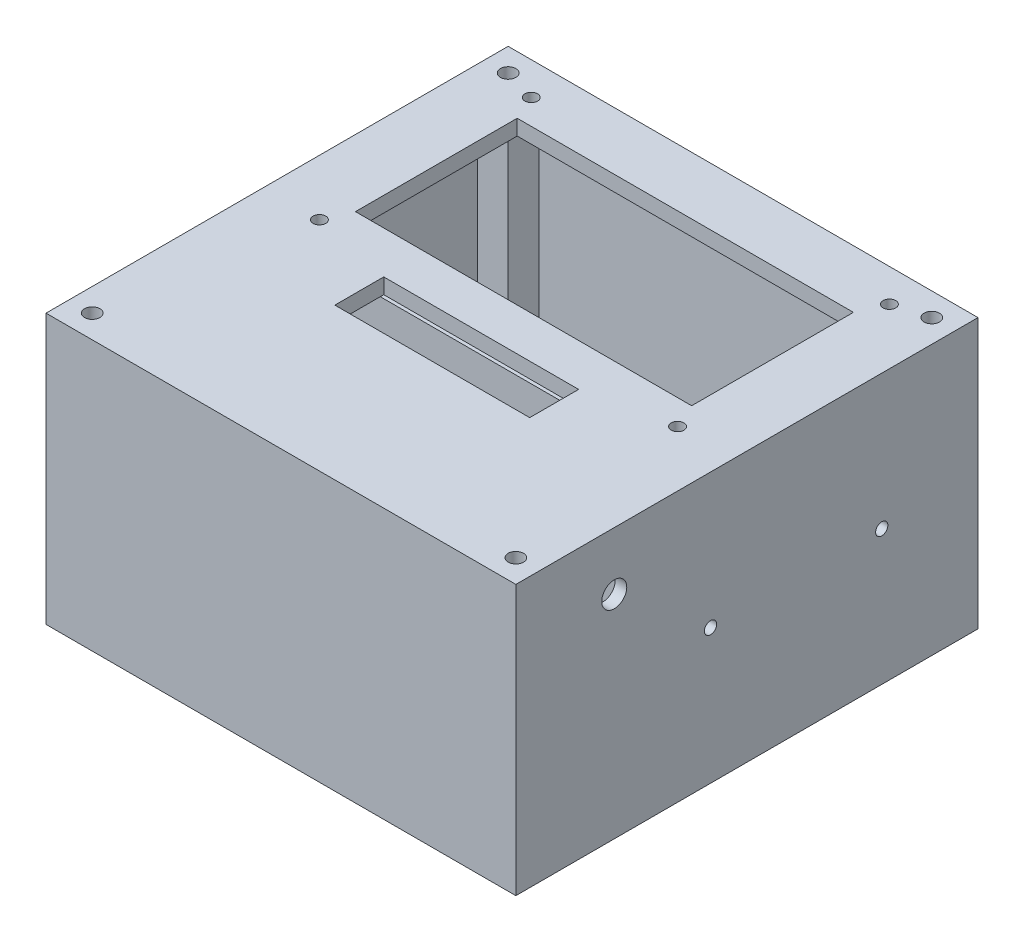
ISO-10303-21;
HEADER;
FILE_DESCRIPTION(('STEP AP214'),'2;1');
FILE_NAME('part.step','',(''),(''),'','','');
FILE_SCHEMA(('AUTOMOTIVE_DESIGN { 1 0 10303 214 1 1 1 1 }'));
ENDSEC;
DATA;
#1=APPLICATION_CONTEXT('core data for automotive mechanical design processes');
#2=APPLICATION_PROTOCOL_DEFINITION('international standard','automotive_design',2000,#1);
#3=PRODUCT_CONTEXT('',#1,'mechanical');
#4=PRODUCT('Part','Part','',(#3));
#5=PRODUCT_RELATED_PRODUCT_CATEGORY('part','',(#4));
#6=PRODUCT_DEFINITION_FORMATION('','',#4);
#7=PRODUCT_DEFINITION_CONTEXT('part definition',#1,'design');
#8=PRODUCT_DEFINITION('design','',#6,#7);
#9=PRODUCT_DEFINITION_SHAPE('','',#8);
#10=(LENGTH_UNIT() NAMED_UNIT(*) SI_UNIT(.MILLI.,.METRE.));
#11=(NAMED_UNIT(*) PLANE_ANGLE_UNIT() SI_UNIT($,.RADIAN.));
#12=(NAMED_UNIT(*) SI_UNIT($,.STERADIAN.) SOLID_ANGLE_UNIT());
#13=UNCERTAINTY_MEASURE_WITH_UNIT(LENGTH_MEASURE(1.E-05),#10,'distance_accuracy_value','');
#14=(GEOMETRIC_REPRESENTATION_CONTEXT(3) GLOBAL_UNCERTAINTY_ASSIGNED_CONTEXT((#13)) GLOBAL_UNIT_ASSIGNED_CONTEXT((#10,
#11,#12)) REPRESENTATION_CONTEXT('',''));
#15=CARTESIAN_POINT('',(0.,0.,0.));
#16=DIRECTION('',(0.,0.,1.));
#17=DIRECTION('',(1.,0.,0.));
#18=AXIS2_PLACEMENT_3D('',#15,#16,#17);
#19=CARTESIAN_POINT('',(-58.,56.,57.));
#20=DIRECTION('',(-1.,0.,0.));
#21=DIRECTION('',(0.,0.,1.));
#22=AXIS2_PLACEMENT_3D('',#19,#20,#21);
#23=PLANE('',#22);
#24=CARTESIAN_POINT('',(-58.,46.575,-8.37500000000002));
#25=DIRECTION('',(1.,0.,0.));
#26=DIRECTION('',(0.,0.,-1.));
#27=AXIS2_PLACEMENT_3D('',#24,#25,#26);
#28=CIRCLE('',#27,2.75);
#29=CARTESIAN_POINT('',(-58.,46.575,-11.125));
#30=VERTEX_POINT('',#29);
#31=EDGE_CURVE('E810',#30,#30,#28,.T.);
#32=ORIENTED_EDGE('',*,*,#31,.F.);
#33=EDGE_LOOP('',(#32));
#34=FACE_BOUND('',#33,.T.);
#35=DIRECTION('',(0.,1.,0.));
#36=VECTOR('',#35,1.);
#37=CARTESIAN_POINT('',(-58.,-21.3137084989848,49.));
#38=LINE('',#37,#36);
#39=CARTESIAN_POINT('',(-58.,-10.,49.));
#40=VERTEX_POINT('',#39);
#41=CARTESIAN_POINT('',(-58.,56.,49.));
#42=VERTEX_POINT('',#41);
#43=EDGE_CURVE('E403',#40,#42,#38,.T.);
#44=ORIENTED_EDGE('',*,*,#43,.F.);
#45=DIRECTION('',(0.,0.,-1.));
#46=VECTOR('',#45,1.);
#47=CARTESIAN_POINT('',(-58.,-10.,57.));
#48=LINE('',#47,#46);
#49=CARTESIAN_POINT('',(-58.,-10.,-49.));
#50=VERTEX_POINT('',#49);
#51=EDGE_CURVE('E573',#40,#50,#48,.T.);
#52=ORIENTED_EDGE('',*,*,#51,.T.);
#53=DIRECTION('',(0.,1.,0.));
#54=VECTOR('',#53,1.);
#55=CARTESIAN_POINT('',(-58.,-21.3137084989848,-49.));
#56=LINE('',#55,#54);
#57=CARTESIAN_POINT('',(-58.,56.,-49.));
#58=VERTEX_POINT('',#57);
#59=EDGE_CURVE('E425',#50,#58,#56,.T.);
#60=ORIENTED_EDGE('',*,*,#59,.T.);
#61=DIRECTION('',(0.,0.,-1.));
#62=VECTOR('',#61,1.);
#63=CARTESIAN_POINT('',(-58.,56.,57.));
#64=LINE('',#63,#62);
#65=EDGE_CURVE('E580',#42,#58,#64,.T.);
#66=ORIENTED_EDGE('',*,*,#65,.F.);
#67=EDGE_LOOP('',(#44,#52,#60,#66));
#68=FACE_BOUND('',#67,.T.);
#69=DIRECTION('',(0.,1.,0.));
#70=VECTOR('',#69,1.);
#71=CARTESIAN_POINT('',(-58.,44.,34.475));
#72=LINE('',#71,#70);
#73=CARTESIAN_POINT('',(-58.,1.99999999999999,34.475));
#74=VERTEX_POINT('',#73);
#75=CARTESIAN_POINT('',(-58.,44.,34.475));
#76=VERTEX_POINT('',#75);
#77=EDGE_CURVE('E512',#74,#76,#72,.T.);
#78=ORIENTED_EDGE('',*,*,#77,.F.);
#79=DIRECTION('',(0.,0.,-1.));
#80=VECTOR('',#79,1.);
#81=CARTESIAN_POINT('',(-58.,1.99999999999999,44.));
#82=LINE('',#81,#80);
#83=CARTESIAN_POINT('',(-58.,1.99999999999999,44.));
#84=VERTEX_POINT('',#83);
#85=EDGE_CURVE('E517',#84,#74,#82,.T.);
#86=ORIENTED_EDGE('',*,*,#85,.F.);
#87=DIRECTION('',(0.,-1.,0.));
#88=VECTOR('',#87,1.);
#89=CARTESIAN_POINT('',(-58.,44.,44.));
#90=LINE('',#89,#88);
#91=CARTESIAN_POINT('',(-58.,44.,44.));
#92=VERTEX_POINT('',#91);
#93=EDGE_CURVE('E529',#92,#84,#90,.T.);
#94=ORIENTED_EDGE('',*,*,#93,.F.);
#95=DIRECTION('',(0.,0.,1.));
#96=VECTOR('',#95,1.);
#97=CARTESIAN_POINT('',(-58.,44.,44.));
#98=LINE('',#97,#96);
#99=EDGE_CURVE('E526',#76,#92,#98,.T.);
#100=ORIENTED_EDGE('',*,*,#99,.F.);
#101=EDGE_LOOP('',(#78,#86,#94,#100));
#102=FACE_BOUND('',#101,.T.);
#103=CARTESIAN_POINT('',(-58.,23.,21.225));
#104=DIRECTION('',(1.,0.,0.));
#105=DIRECTION('',(0.,0.,-1.));
#106=AXIS2_PLACEMENT_3D('',#103,#104,#105);
#107=CIRCLE('',#106,8.5);
#108=CARTESIAN_POINT('',(-58.,23.,12.725));
#109=VERTEX_POINT('',#108);
#110=EDGE_CURVE('E480',#109,#109,#107,.T.);
#111=ORIENTED_EDGE('',*,*,#110,.F.);
#112=EDGE_LOOP('',(#111));
#113=FACE_BOUND('',#112,.T.);
#114=DIRECTION('',(0.,-1.,0.));
#115=VECTOR('',#114,1.);
#116=CARTESIAN_POINT('',(-58.,51.575,4.47500000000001));
#117=LINE('',#116,#115);
#118=CARTESIAN_POINT('',(-58.,51.575,4.47500000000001));
#119=VERTEX_POINT('',#118);
#120=CARTESIAN_POINT('',(-58.,-5.57500000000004,4.475));
#121=VERTEX_POINT('',#120);
#122=EDGE_CURVE('E302',#119,#121,#117,.T.);
#123=ORIENTED_EDGE('',*,*,#122,.F.);
#124=DIRECTION('',(0.,0.,1.));
#125=VECTOR('',#124,1.);
#126=CARTESIAN_POINT('',(-58.,51.575,-1.87499999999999));
#127=LINE('',#126,#125);
#128=CARTESIAN_POINT('',(-58.,51.575,-1.87499999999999));
#129=VERTEX_POINT('',#128);
#130=EDGE_CURVE('E299',#129,#119,#127,.T.);
#131=ORIENTED_EDGE('',*,*,#130,.F.);
#132=DIRECTION('',(0.,1.,0.));
#133=VECTOR('',#132,1.);
#134=CARTESIAN_POINT('',(-58.,51.575,-1.87499999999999));
#135=LINE('',#134,#133);
#136=CARTESIAN_POINT('',(-58.,-5.57500000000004,-1.87500000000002));
#137=VERTEX_POINT('',#136);
#138=EDGE_CURVE('E70',#137,#129,#135,.T.);
#139=ORIENTED_EDGE('',*,*,#138,.F.);
#140=DIRECTION('',(0.,0.,-1.));
#141=VECTOR('',#140,1.);
#142=CARTESIAN_POINT('',(-58.,-5.57500000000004,-1.87500000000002));
#143=LINE('',#142,#141);
#144=EDGE_CURVE('E65',#121,#137,#143,.T.);
#145=ORIENTED_EDGE('',*,*,#144,.F.);
#146=EDGE_LOOP('',(#123,#131,#139,#145));
#147=FACE_BOUND('',#146,.T.);
#148=ADVANCED_FACE('F48',(#34,#68,#102,#113,#147),#23,.F.);
#149=CARTESIAN_POINT('',(0.,56.,0.));
#150=DIRECTION('',(0.,-1.,0.));
#151=DIRECTION('',(0.,0.,-1.));
#152=AXIS2_PLACEMENT_3D('',#149,#150,#151);
#153=PLANE('',#152);
#154=DIRECTION('',(0.,0.,1.));
#155=VECTOR('',#154,1.);
#156=CARTESIAN_POINT('',(-25.3,56.,8.00000000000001));
#157=LINE('',#156,#155);
#158=CARTESIAN_POINT('',(-25.3,56.,8.00000000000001));
#159=VERTEX_POINT('',#158);
#160=CARTESIAN_POINT('',(-25.3,56.,20.7));
#161=VERTEX_POINT('',#160);
#162=EDGE_CURVE('E314',#159,#161,#157,.T.);
#163=ORIENTED_EDGE('',*,*,#162,.T.);
#164=DIRECTION('',(1.,0.,0.));
#165=VECTOR('',#164,1.);
#166=CARTESIAN_POINT('',(25.3,56.,20.7));
#167=LINE('',#166,#165);
#168=CARTESIAN_POINT('',(25.3,56.,20.7));
#169=VERTEX_POINT('',#168);
#170=EDGE_CURVE('E331',#161,#169,#167,.T.);
#171=ORIENTED_EDGE('',*,*,#170,.T.);
#172=DIRECTION('',(0.,0.,-1.));
#173=VECTOR('',#172,1.);
#174=CARTESIAN_POINT('',(25.3,56.,8.));
#175=LINE('',#174,#173);
#176=CARTESIAN_POINT('',(25.3,56.,8.));
#177=VERTEX_POINT('',#176);
#178=EDGE_CURVE('E303',#169,#177,#175,.T.);
#179=ORIENTED_EDGE('',*,*,#178,.T.);
#180=DIRECTION('',(-1.,0.,0.));
#181=VECTOR('',#180,1.);
#182=CARTESIAN_POINT('',(25.3,56.,8.));
#183=LINE('',#182,#181);
#184=EDGE_CURVE('E306',#177,#159,#183,.T.);
#185=ORIENTED_EDGE('',*,*,#184,.T.);
#186=EDGE_LOOP('',(#163,#171,#179,#185));
#187=FACE_BOUND('',#186,.T.);
#188=CARTESIAN_POINT('',(46.5,56.,-51.5));
#189=DIRECTION('',(0.,-1.,0.));
#190=DIRECTION('',(0.,0.,-1.));
#191=AXIS2_PLACEMENT_3D('',#188,#189,#190);
#192=CIRCLE('',#191,1.65);
#193=CARTESIAN_POINT('',(46.5,56.,-53.15));
#194=VERTEX_POINT('',#193);
#195=EDGE_CURVE('E52',#194,#194,#192,.T.);
#196=ORIENTED_EDGE('',*,*,#195,.F.);
#197=EDGE_LOOP('',(#196));
#198=FACE_BOUND('',#197,.T.);
#199=CARTESIAN_POINT('',(46.5,56.,3.50000000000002));
#200=DIRECTION('',(0.,-1.,0.));
#201=DIRECTION('',(0.,0.,-1.));
#202=AXIS2_PLACEMENT_3D('',#199,#200,#201);
#203=CIRCLE('',#202,1.65);
#204=CARTESIAN_POINT('',(46.5,56.,1.85000000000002));
#205=VERTEX_POINT('',#204);
#206=EDGE_CURVE('E642',#205,#205,#203,.T.);
#207=ORIENTED_EDGE('',*,*,#206,.F.);
#208=EDGE_LOOP('',(#207));
#209=FACE_BOUND('',#208,.T.);
#210=CARTESIAN_POINT('',(-46.5,56.,3.50000000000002));
#211=DIRECTION('',(0.,-1.,0.));
#212=DIRECTION('',(0.,0.,-1.));
#213=AXIS2_PLACEMENT_3D('',#210,#211,#212);
#214=CIRCLE('',#213,1.65);
#215=CARTESIAN_POINT('',(-46.5,56.,1.85000000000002));
#216=VERTEX_POINT('',#215);
#217=EDGE_CURVE('E549',#216,#216,#214,.T.);
#218=ORIENTED_EDGE('',*,*,#217,.F.);
#219=EDGE_LOOP('',(#218));
#220=FACE_BOUND('',#219,.T.);
#221=CARTESIAN_POINT('',(-46.5,56.,-51.5));
#222=DIRECTION('',(0.,-1.,0.));
#223=DIRECTION('',(0.,0.,-1.));
#224=AXIS2_PLACEMENT_3D('',#221,#222,#223);
#225=CIRCLE('',#224,1.65);
#226=CARTESIAN_POINT('',(-46.5,56.,-53.15));
#227=VERTEX_POINT('',#226);
#228=EDGE_CURVE('E558',#227,#227,#225,.T.);
#229=ORIENTED_EDGE('',*,*,#228,.F.);
#230=EDGE_LOOP('',(#229));
#231=FACE_BOUND('',#230,.T.);
#232=DIRECTION('',(0.,0.,-1.));
#233=VECTOR('',#232,1.);
#234=CARTESIAN_POINT('',(-43.65,56.,0.));
#235=LINE('',#234,#233);
#236=CARTESIAN_POINT('',(-43.65,56.,-2.99999999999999));
#237=VERTEX_POINT('',#236);
#238=CARTESIAN_POINT('',(-43.65,56.,-45.));
#239=VERTEX_POINT('',#238);
#240=EDGE_CURVE('E13',#237,#239,#235,.T.);
#241=ORIENTED_EDGE('',*,*,#240,.F.);
#242=DIRECTION('',(-1.,0.,0.));
#243=VECTOR('',#242,1.);
#244=CARTESIAN_POINT('',(0.,56.,-2.99999999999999));
#245=LINE('',#244,#243);
#246=CARTESIAN_POINT('',(43.65,56.,-3.));
#247=VERTEX_POINT('',#246);
#248=EDGE_CURVE('E628',#247,#237,#245,.T.);
#249=ORIENTED_EDGE('',*,*,#248,.F.);
#250=DIRECTION('',(0.,0.,1.));
#251=VECTOR('',#250,1.);
#252=CARTESIAN_POINT('',(43.65,56.,0.));
#253=LINE('',#252,#251);
#254=CARTESIAN_POINT('',(43.65,56.,-45.));
#255=VERTEX_POINT('',#254);
#256=EDGE_CURVE('E635',#255,#247,#253,.T.);
#257=ORIENTED_EDGE('',*,*,#256,.F.);
#258=DIRECTION('',(1.,0.,0.));
#259=VECTOR('',#258,1.);
#260=CARTESIAN_POINT('',(0.,56.,-45.));
#261=LINE('',#260,#259);
#262=EDGE_CURVE('E57',#239,#255,#261,.T.);
#263=ORIENTED_EDGE('',*,*,#262,.F.);
#264=EDGE_LOOP('',(#241,#249,#257,#263));
#265=FACE_BOUND('',#264,.T.);
#266=DIRECTION('',(1.,0.,0.));
#267=VECTOR('',#266,1.);
#268=CARTESIAN_POINT('',(-58.,56.,-57.));
#269=LINE('',#268,#267);
#270=CARTESIAN_POINT('',(-50.,56.,-57.));
#271=VERTEX_POINT('',#270);
#272=CARTESIAN_POINT('',(50.,56.,-57.));
#273=VERTEX_POINT('',#272);
#274=EDGE_CURVE('E582',#271,#273,#269,.T.);
#275=ORIENTED_EDGE('',*,*,#274,.T.);
#276=DIRECTION('',(0.,0.,-1.));
#277=VECTOR('',#276,1.);
#278=CARTESIAN_POINT('',(50.,56.,-57.));
#279=LINE('',#278,#277);
#280=CARTESIAN_POINT('',(50.,56.,-49.));
#281=VERTEX_POINT('',#280);
#282=EDGE_CURVE('E374',#281,#273,#279,.T.);
#283=ORIENTED_EDGE('',*,*,#282,.F.);
#284=DIRECTION('',(-1.,0.,0.));
#285=VECTOR('',#284,1.);
#286=CARTESIAN_POINT('',(58.,56.,-49.));
#287=LINE('',#286,#285);
#288=CARTESIAN_POINT('',(58.,56.,-49.));
#289=VERTEX_POINT('',#288);
#290=EDGE_CURVE('E362',#289,#281,#287,.T.);
#291=ORIENTED_EDGE('',*,*,#290,.F.);
#292=DIRECTION('',(0.,0.,-1.));
#293=VECTOR('',#292,1.);
#294=CARTESIAN_POINT('',(58.,56.,57.));
#295=LINE('',#294,#293);
#296=CARTESIAN_POINT('',(58.,56.,49.));
#297=VERTEX_POINT('',#296);
#298=EDGE_CURVE('E586',#297,#289,#295,.T.);
#299=ORIENTED_EDGE('',*,*,#298,.F.);
#300=DIRECTION('',(1.,0.,0.));
#301=VECTOR('',#300,1.);
#302=CARTESIAN_POINT('',(58.,56.,49.));
#303=LINE('',#302,#301);
#304=CARTESIAN_POINT('',(50.,56.,49.));
#305=VERTEX_POINT('',#304);
#306=EDGE_CURVE('E388',#305,#297,#303,.T.);
#307=ORIENTED_EDGE('',*,*,#306,.F.);
#308=DIRECTION('',(0.,0.,-1.));
#309=VECTOR('',#308,1.);
#310=CARTESIAN_POINT('',(50.,56.,57.));
#311=LINE('',#310,#309);
#312=CARTESIAN_POINT('',(50.,56.,57.));
#313=VERTEX_POINT('',#312);
#314=EDGE_CURVE('E371',#313,#305,#311,.T.);
#315=ORIENTED_EDGE('',*,*,#314,.F.);
#316=DIRECTION('',(1.,0.,0.));
#317=VECTOR('',#316,1.);
#318=CARTESIAN_POINT('',(-58.,56.,57.));
#319=LINE('',#318,#317);
#320=CARTESIAN_POINT('',(-50.,56.,57.));
#321=VERTEX_POINT('',#320);
#322=EDGE_CURVE('E589',#321,#313,#319,.T.);
#323=ORIENTED_EDGE('',*,*,#322,.F.);
#324=DIRECTION('',(0.,0.,1.));
#325=VECTOR('',#324,1.);
#326=CARTESIAN_POINT('',(-50.,56.,57.));
#327=LINE('',#326,#325);
#328=CARTESIAN_POINT('',(-50.,56.,49.));
#329=VERTEX_POINT('',#328);
#330=EDGE_CURVE('E408',#329,#321,#327,.T.);
#331=ORIENTED_EDGE('',*,*,#330,.F.);
#332=DIRECTION('',(1.,0.,0.));
#333=VECTOR('',#332,1.);
#334=CARTESIAN_POINT('',(-58.,56.,49.));
#335=LINE('',#334,#333);
#336=EDGE_CURVE('E384',#42,#329,#335,.T.);
#337=ORIENTED_EDGE('',*,*,#336,.F.);
#338=ORIENTED_EDGE('',*,*,#65,.T.);
#339=DIRECTION('',(-1.,0.,0.));
#340=VECTOR('',#339,1.);
#341=CARTESIAN_POINT('',(-58.,56.,-49.));
#342=LINE('',#341,#340);
#343=CARTESIAN_POINT('',(-50.,56.,-49.));
#344=VERTEX_POINT('',#343);
#345=EDGE_CURVE('E422',#344,#58,#342,.T.);
#346=ORIENTED_EDGE('',*,*,#345,.F.);
#347=DIRECTION('',(0.,0.,1.));
#348=VECTOR('',#347,1.);
#349=CARTESIAN_POINT('',(-50.,56.,-57.));
#350=LINE('',#349,#348);
#351=EDGE_CURVE('E405',#271,#344,#350,.T.);
#352=ORIENTED_EDGE('',*,*,#351,.F.);
#353=EDGE_LOOP('',(#275,#283,#291,#299,#307,#315,#323,#331,#337,#338,#346,#352));
#354=FACE_BOUND('',#353,.T.);
#355=ADVANCED_FACE('F652',(#187,#198,#209,#220,#231,#265,#354),#153,.T.);
#356=CARTESIAN_POINT('',(58.,56.,57.));
#357=DIRECTION('',(-1.,0.,0.));
#358=DIRECTION('',(0.,0.,1.));
#359=AXIS2_PLACEMENT_3D('',#356,#357,#358);
#360=PLANE('',#359);
#361=CARTESIAN_POINT('',(58.,25.,-35.));
#362=DIRECTION('',(-1.,0.,0.));
#363=DIRECTION('',(0.,0.,1.));
#364=AXIS2_PLACEMENT_3D('',#361,#362,#363);
#365=CIRCLE('',#364,1.5875);
#366=CARTESIAN_POINT('',(58.,25.,-33.4125));
#367=VERTEX_POINT('',#366);
#368=EDGE_CURVE('E469',#367,#367,#365,.F.);
#369=ORIENTED_EDGE('',*,*,#368,.T.);
#370=EDGE_LOOP('',(#369));
#371=FACE_BOUND('',#370,.T.);
#372=CARTESIAN_POINT('',(58.,45.,34.45));
#373=DIRECTION('',(-1.,0.,0.));
#374=DIRECTION('',(0.,0.,1.));
#375=AXIS2_PLACEMENT_3D('',#372,#373,#374);
#376=CIRCLE('',#375,3.25);
#377=CARTESIAN_POINT('',(58.,45.,37.7));
#378=VERTEX_POINT('',#377);
#379=EDGE_CURVE('E464',#378,#378,#376,.F.);
#380=ORIENTED_EDGE('',*,*,#379,.T.);
#381=EDGE_LOOP('',(#380));
#382=FACE_BOUND('',#381,.T.);
#383=CARTESIAN_POINT('',(58.,25.,9.45));
#384=DIRECTION('',(-1.,0.,0.));
#385=DIRECTION('',(0.,0.,1.));
#386=AXIS2_PLACEMENT_3D('',#383,#384,#385);
#387=CIRCLE('',#386,1.5875);
#388=CARTESIAN_POINT('',(58.,25.,11.0375));
#389=VERTEX_POINT('',#388);
#390=EDGE_CURVE('E468',#389,#389,#387,.F.);
#391=ORIENTED_EDGE('',*,*,#390,.T.);
#392=EDGE_LOOP('',(#391));
#393=FACE_BOUND('',#392,.T.);
#394=ORIENTED_EDGE('',*,*,#298,.T.);
#395=DIRECTION('',(0.,1.,0.));
#396=VECTOR('',#395,1.);
#397=CARTESIAN_POINT('',(58.,-21.3137084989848,-49.));
#398=LINE('',#397,#396);
#399=CARTESIAN_POINT('',(58.,-10.,-49.));
#400=VERTEX_POINT('',#399);
#401=EDGE_CURVE('E369',#400,#289,#398,.T.);
#402=ORIENTED_EDGE('',*,*,#401,.F.);
#403=DIRECTION('',(0.,0.,-1.));
#404=VECTOR('',#403,1.);
#405=CARTESIAN_POINT('',(58.,-10.,57.));
#406=LINE('',#405,#404);
#407=CARTESIAN_POINT('',(58.,-10.,49.));
#408=VERTEX_POINT('',#407);
#409=EDGE_CURVE('E597',#408,#400,#406,.T.);
#410=ORIENTED_EDGE('',*,*,#409,.F.);
#411=DIRECTION('',(0.,1.,0.));
#412=VECTOR('',#411,1.);
#413=CARTESIAN_POINT('',(58.,-21.3137084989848,49.));
#414=LINE('',#413,#412);
#415=EDGE_CURVE('E390',#408,#297,#414,.T.);
#416=ORIENTED_EDGE('',*,*,#415,.T.);
#417=EDGE_LOOP('',(#394,#402,#410,#416));
#418=FACE_BOUND('',#417,.T.);
#419=ADVANCED_FACE('F655',(#371,#382,#393,#418),#360,.T.);
#420=CARTESIAN_POINT('',(-58.,56.,-57.));
#421=DIRECTION('',(0.,0.,-1.));
#422=DIRECTION('',(-1.,0.,0.));
#423=AXIS2_PLACEMENT_3D('',#420,#421,#422);
#424=PLANE('',#423);
#425=DIRECTION('',(0.,1.,0.));
#426=VECTOR('',#425,1.);
#427=CARTESIAN_POINT('',(38.,19.,-57.));
#428=LINE('',#427,#426);
#429=CARTESIAN_POINT('',(38.,19.,-57.));
#430=VERTEX_POINT('',#429);
#431=CARTESIAN_POINT('',(38.,31.,-57.));
#432=VERTEX_POINT('',#431);
#433=EDGE_CURVE('E439',#430,#432,#428,.T.);
#434=ORIENTED_EDGE('',*,*,#433,.F.);
#435=DIRECTION('',(1.,0.,0.));
#436=VECTOR('',#435,1.);
#437=CARTESIAN_POINT('',(24.,19.,-57.));
#438=LINE('',#437,#436);
#439=CARTESIAN_POINT('',(24.,19.,-57.));
#440=VERTEX_POINT('',#439);
#441=EDGE_CURVE('E457',#440,#430,#438,.T.);
#442=ORIENTED_EDGE('',*,*,#441,.F.);
#443=DIRECTION('',(0.,-1.,0.));
#444=VECTOR('',#443,1.);
#445=CARTESIAN_POINT('',(24.,19.,-57.));
#446=LINE('',#445,#444);
#447=CARTESIAN_POINT('',(24.,31.,-57.));
#448=VERTEX_POINT('',#447);
#449=EDGE_CURVE('E418',#448,#440,#446,.T.);
#450=ORIENTED_EDGE('',*,*,#449,.F.);
#451=DIRECTION('',(-1.,0.,0.));
#452=VECTOR('',#451,1.);
#453=CARTESIAN_POINT('',(24.,31.,-57.));
#454=LINE('',#453,#452);
#455=EDGE_CURVE('E436',#432,#448,#454,.T.);
#456=ORIENTED_EDGE('',*,*,#455,.F.);
#457=EDGE_LOOP('',(#434,#442,#450,#456));
#458=FACE_BOUND('',#457,.T.);
#459=DIRECTION('',(0.,1.,0.));
#460=VECTOR('',#459,1.);
#461=CARTESIAN_POINT('',(50.,-21.3137084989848,-57.));
#462=LINE('',#461,#460);
#463=CARTESIAN_POINT('',(50.,-10.,-57.));
#464=VERTEX_POINT('',#463);
#465=EDGE_CURVE('E376',#464,#273,#462,.T.);
#466=ORIENTED_EDGE('',*,*,#465,.T.);
#467=ORIENTED_EDGE('',*,*,#274,.F.);
#468=DIRECTION('',(0.,1.,0.));
#469=VECTOR('',#468,1.);
#470=CARTESIAN_POINT('',(-50.,-21.3137084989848,-57.));
#471=LINE('',#470,#469);
#472=CARTESIAN_POINT('',(-50.,-10.,-57.));
#473=VERTEX_POINT('',#472);
#474=EDGE_CURVE('E430',#473,#271,#471,.T.);
#475=ORIENTED_EDGE('',*,*,#474,.F.);
#476=DIRECTION('',(1.,0.,0.));
#477=VECTOR('',#476,1.);
#478=CARTESIAN_POINT('',(-58.,-10.,-57.));
#479=LINE('',#478,#477);
#480=EDGE_CURVE('E594',#473,#464,#479,.T.);
#481=ORIENTED_EDGE('',*,*,#480,.T.);
#482=EDGE_LOOP('',(#466,#467,#475,#481));
#483=FACE_BOUND('',#482,.T.);
#484=ADVANCED_FACE('F674',(#458,#483),#424,.F.);
#485=CARTESIAN_POINT('',(-58.,56.,57.));
#486=DIRECTION('',(0.,0.,-1.));
#487=DIRECTION('',(-1.,0.,0.));
#488=AXIS2_PLACEMENT_3D('',#485,#486,#487);
#489=PLANE('',#488);
#490=ORIENTED_EDGE('',*,*,#322,.T.);
#491=DIRECTION('',(0.,1.,0.));
#492=VECTOR('',#491,1.);
#493=CARTESIAN_POINT('',(50.,-21.3137084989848,57.));
#494=LINE('',#493,#492);
#495=CARTESIAN_POINT('',(50.,-10.,57.));
#496=VERTEX_POINT('',#495);
#497=EDGE_CURVE('E395',#496,#313,#494,.T.);
#498=ORIENTED_EDGE('',*,*,#497,.F.);
#499=DIRECTION('',(1.,0.,0.));
#500=VECTOR('',#499,1.);
#501=CARTESIAN_POINT('',(-58.,-10.,57.));
#502=LINE('',#501,#500);
#503=CARTESIAN_POINT('',(-50.,-10.,57.));
#504=VERTEX_POINT('',#503);
#505=EDGE_CURVE('E583',#504,#496,#502,.T.);
#506=ORIENTED_EDGE('',*,*,#505,.F.);
#507=DIRECTION('',(0.,1.,0.));
#508=VECTOR('',#507,1.);
#509=CARTESIAN_POINT('',(-50.,-21.3137084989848,57.));
#510=LINE('',#509,#508);
#511=EDGE_CURVE('E410',#504,#321,#510,.T.);
#512=ORIENTED_EDGE('',*,*,#511,.T.);
#513=EDGE_LOOP('',(#490,#498,#506,#512));
#514=FACE_BOUND('',#513,.T.);
#515=ADVANCED_FACE('F703',(#514),#489,.T.);
#516=CARTESIAN_POINT('',(-61.,-10.,60.));
#517=DIRECTION('',(-1.,0.,0.));
#518=DIRECTION('',(0.,0.,1.));
#519=AXIS2_PLACEMENT_3D('',#516,#517,#518);
#520=PLANE('',#519);
#521=CARTESIAN_POINT('',(-61.,13.4188,39.2335633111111));
#522=DIRECTION('',(-1.,0.,0.));
#523=DIRECTION('',(0.,0.,1.));
#524=AXIS2_PLACEMENT_3D('',#521,#522,#523);
#525=CIRCLE('',#524,2.41299999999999);
#526=CARTESIAN_POINT('',(-61.,13.4188,41.6465633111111));
#527=VERTEX_POINT('',#526);
#528=EDGE_CURVE('E782',#527,#527,#525,.T.);
#529=ORIENTED_EDGE('',*,*,#528,.F.);
#530=EDGE_LOOP('',(#529));
#531=FACE_BOUND('',#530,.T.);
#532=CARTESIAN_POINT('',(-61.,32.5704,39.2462633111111));
#533=DIRECTION('',(-1.,0.,0.));
#534=DIRECTION('',(0.,0.,1.));
#535=AXIS2_PLACEMENT_3D('',#532,#533,#534);
#536=CIRCLE('',#535,2.41299999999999);
#537=CARTESIAN_POINT('',(-61.,32.5704,41.6592633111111));
#538=VERTEX_POINT('',#537);
#539=EDGE_CURVE('E786',#538,#538,#536,.T.);
#540=ORIENTED_EDGE('',*,*,#539,.F.);
#541=EDGE_LOOP('',(#540));
#542=FACE_BOUND('',#541,.T.);
#543=CARTESIAN_POINT('',(-61.,39.149,1.31140000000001));
#544=DIRECTION('',(-1.,0.,0.));
#545=DIRECTION('',(0.,0.,1.));
#546=AXIS2_PLACEMENT_3D('',#543,#544,#545);
#547=CIRCLE('',#546,2.41299999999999);
#548=CARTESIAN_POINT('',(-61.,39.149,3.7244));
#549=VERTEX_POINT('',#548);
#550=EDGE_CURVE('E790',#549,#549,#547,.T.);
#551=ORIENTED_EDGE('',*,*,#550,.F.);
#552=EDGE_LOOP('',(#551));
#553=FACE_BOUND('',#552,.T.);
#554=CARTESIAN_POINT('',(-61.,6.8402,1.31140000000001));
#555=DIRECTION('',(-1.,0.,0.));
#556=DIRECTION('',(0.,0.,1.));
#557=AXIS2_PLACEMENT_3D('',#554,#555,#556);
#558=CIRCLE('',#557,2.413);
#559=CARTESIAN_POINT('',(-61.,6.8402,3.72440000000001));
#560=VERTEX_POINT('',#559);
#561=EDGE_CURVE('E794',#560,#560,#558,.T.);
#562=ORIENTED_EDGE('',*,*,#561,.F.);
#563=EDGE_LOOP('',(#562));
#564=FACE_BOUND('',#563,.T.);
#565=CARTESIAN_POINT('',(-61.,46.575,-8.37500000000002));
#566=DIRECTION('',(-1.,0.,0.));
#567=DIRECTION('',(0.,0.,1.));
#568=AXIS2_PLACEMENT_3D('',#565,#566,#567);
#569=CIRCLE('',#568,2.75);
#570=CARTESIAN_POINT('',(-61.,46.575,-5.62500000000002));
#571=VERTEX_POINT('',#570);
#572=EDGE_CURVE('E798',#571,#571,#569,.F.);
#573=ORIENTED_EDGE('',*,*,#572,.T.);
#574=EDGE_LOOP('',(#573));
#575=FACE_BOUND('',#574,.T.);
#576=CARTESIAN_POINT('',(-61.,23.,21.225));
#577=DIRECTION('',(1.,0.,0.));
#578=DIRECTION('',(0.,0.,-1.));
#579=AXIS2_PLACEMENT_3D('',#576,#577,#578);
#580=CIRCLE('',#579,8.5);
#581=CARTESIAN_POINT('',(-61.,23.,12.725));
#582=VERTEX_POINT('',#581);
#583=EDGE_CURVE('E483',#582,#582,#580,.T.);
#584=ORIENTED_EDGE('',*,*,#583,.T.);
#585=EDGE_LOOP('',(#584));
#586=FACE_BOUND('',#585,.T.);
#587=DIRECTION('',(0.,1.,0.));
#588=VECTOR('',#587,1.);
#589=CARTESIAN_POINT('',(-61.,-10.,60.));
#590=LINE('',#589,#588);
#591=CARTESIAN_POINT('',(-61.,-10.,60.));
#592=VERTEX_POINT('',#591);
#593=CARTESIAN_POINT('',(-61.,60.,60.));
#594=VERTEX_POINT('',#593);
#595=EDGE_CURVE('E625',#592,#594,#590,.T.);
#596=ORIENTED_EDGE('',*,*,#595,.T.);
#597=DIRECTION('',(0.,0.,1.));
#598=VECTOR('',#597,1.);
#599=CARTESIAN_POINT('',(-61.,60.,60.));
#600=LINE('',#599,#598);
#601=CARTESIAN_POINT('',(-61.,60.,-60.));
#602=VERTEX_POINT('',#601);
#603=EDGE_CURVE('E592',#602,#594,#600,.T.);
#604=ORIENTED_EDGE('',*,*,#603,.F.);
#605=DIRECTION('',(0.,1.,0.));
#606=VECTOR('',#605,1.);
#607=CARTESIAN_POINT('',(-61.,-10.,-60.));
#608=LINE('',#607,#606);
#609=CARTESIAN_POINT('',(-61.,-10.,-60.));
#610=VERTEX_POINT('',#609);
#611=EDGE_CURVE('E626',#610,#602,#608,.T.);
#612=ORIENTED_EDGE('',*,*,#611,.F.);
#613=DIRECTION('',(0.,0.,1.));
#614=VECTOR('',#613,1.);
#615=CARTESIAN_POINT('',(-61.,-10.,60.));
#616=LINE('',#615,#614);
#617=EDGE_CURVE('E613',#610,#592,#616,.T.);
#618=ORIENTED_EDGE('',*,*,#617,.T.);
#619=EDGE_LOOP('',(#596,#604,#612,#618));
#620=FACE_BOUND('',#619,.T.);
#621=ADVANCED_FACE('F50',(#531,#542,#553,#564,#575,#586,#620),#520,.T.);
#622=CARTESIAN_POINT('',(61.,-10.,-60.));
#623=DIRECTION('',(0.,0.,-1.));
#624=DIRECTION('',(-1.,0.,0.));
#625=AXIS2_PLACEMENT_3D('',#622,#623,#624);
#626=PLANE('',#625);
#627=DIRECTION('',(-1.,0.,0.));
#628=VECTOR('',#627,1.);
#629=CARTESIAN_POINT('',(24.,19.,-60.));
#630=LINE('',#629,#628);
#631=CARTESIAN_POINT('',(38.,19.,-60.));
#632=VERTEX_POINT('',#631);
#633=CARTESIAN_POINT('',(24.,19.,-60.));
#634=VERTEX_POINT('',#633);
#635=EDGE_CURVE('E445',#632,#634,#630,.T.);
#636=ORIENTED_EDGE('',*,*,#635,.F.);
#637=DIRECTION('',(0.,-1.,0.));
#638=VECTOR('',#637,1.);
#639=CARTESIAN_POINT('',(38.,19.,-60.));
#640=LINE('',#639,#638);
#641=CARTESIAN_POINT('',(38.,31.,-60.));
#642=VERTEX_POINT('',#641);
#643=EDGE_CURVE('E442',#642,#632,#640,.T.);
#644=ORIENTED_EDGE('',*,*,#643,.F.);
#645=DIRECTION('',(1.,0.,0.));
#646=VECTOR('',#645,1.);
#647=CARTESIAN_POINT('',(24.,31.,-60.));
#648=LINE('',#647,#646);
#649=CARTESIAN_POINT('',(24.,31.,-60.));
#650=VERTEX_POINT('',#649);
#651=EDGE_CURVE('E451',#650,#642,#648,.T.);
#652=ORIENTED_EDGE('',*,*,#651,.F.);
#653=DIRECTION('',(0.,1.,0.));
#654=VECTOR('',#653,1.);
#655=CARTESIAN_POINT('',(24.,19.,-60.));
#656=LINE('',#655,#654);
#657=EDGE_CURVE('E448',#634,#650,#656,.T.);
#658=ORIENTED_EDGE('',*,*,#657,.F.);
#659=EDGE_LOOP('',(#636,#644,#652,#658));
#660=FACE_BOUND('',#659,.T.);
#661=ORIENTED_EDGE('',*,*,#611,.T.);
#662=DIRECTION('',(-1.,0.,0.));
#663=VECTOR('',#662,1.);
#664=CARTESIAN_POINT('',(61.,60.,-60.));
#665=LINE('',#664,#663);
#666=CARTESIAN_POINT('',(61.,60.,-60.));
#667=VERTEX_POINT('',#666);
#668=EDGE_CURVE('E610',#667,#602,#665,.T.);
#669=ORIENTED_EDGE('',*,*,#668,.F.);
#670=DIRECTION('',(0.,1.,0.));
#671=VECTOR('',#670,1.);
#672=CARTESIAN_POINT('',(61.,-10.,-60.));
#673=LINE('',#672,#671);
#674=CARTESIAN_POINT('',(61.,-10.,-60.));
#675=VERTEX_POINT('',#674);
#676=EDGE_CURVE('E629',#675,#667,#673,.T.);
#677=ORIENTED_EDGE('',*,*,#676,.F.);
#678=DIRECTION('',(-1.,0.,0.));
#679=VECTOR('',#678,1.);
#680=CARTESIAN_POINT('',(61.,-10.,-60.));
#681=LINE('',#680,#679);
#682=EDGE_CURVE('E622',#675,#610,#681,.T.);
#683=ORIENTED_EDGE('',*,*,#682,.T.);
#684=EDGE_LOOP('',(#661,#669,#677,#683));
#685=FACE_BOUND('',#684,.T.);
#686=ADVANCED_FACE('F750',(#660,#685),#626,.T.);
#687=CARTESIAN_POINT('',(61.,-10.,60.));
#688=DIRECTION('',(1.,0.,0.));
#689=DIRECTION('',(0.,0.,-1.));
#690=AXIS2_PLACEMENT_3D('',#687,#688,#689);
#691=PLANE('',#690);
#692=CARTESIAN_POINT('',(61.,25.,-35.));
#693=DIRECTION('',(1.,0.,0.));
#694=DIRECTION('',(0.,0.,-1.));
#695=AXIS2_PLACEMENT_3D('',#692,#693,#694);
#696=CIRCLE('',#695,1.5875);
#697=CARTESIAN_POINT('',(61.,25.,-36.5875));
#698=VERTEX_POINT('',#697);
#699=EDGE_CURVE('E465',#698,#698,#696,.T.);
#700=ORIENTED_EDGE('',*,*,#699,.F.);
#701=EDGE_LOOP('',(#700));
#702=FACE_BOUND('',#701,.T.);
#703=CARTESIAN_POINT('',(61.,45.,34.45));
#704=DIRECTION('',(1.,0.,0.));
#705=DIRECTION('',(0.,0.,-1.));
#706=AXIS2_PLACEMENT_3D('',#703,#704,#705);
#707=CIRCLE('',#706,3.25);
#708=CARTESIAN_POINT('',(61.,45.,31.2));
#709=VERTEX_POINT('',#708);
#710=EDGE_CURVE('E472',#709,#709,#707,.T.);
#711=ORIENTED_EDGE('',*,*,#710,.F.);
#712=EDGE_LOOP('',(#711));
#713=FACE_BOUND('',#712,.T.);
#714=CARTESIAN_POINT('',(61.,25.,9.45));
#715=DIRECTION('',(1.,0.,0.));
#716=DIRECTION('',(0.,0.,-1.));
#717=AXIS2_PLACEMENT_3D('',#714,#715,#716);
#718=CIRCLE('',#717,1.5875);
#719=CARTESIAN_POINT('',(61.,25.,7.8625));
#720=VERTEX_POINT('',#719);
#721=EDGE_CURVE('E477',#720,#720,#718,.T.);
#722=ORIENTED_EDGE('',*,*,#721,.F.);
#723=EDGE_LOOP('',(#722));
#724=FACE_BOUND('',#723,.T.);
#725=ORIENTED_EDGE('',*,*,#676,.T.);
#726=DIRECTION('',(0.,0.,-1.));
#727=VECTOR('',#726,1.);
#728=CARTESIAN_POINT('',(61.,60.,60.));
#729=LINE('',#728,#727);
#730=CARTESIAN_POINT('',(61.,60.,60.));
#731=VERTEX_POINT('',#730);
#732=EDGE_CURVE('E607',#731,#667,#729,.T.);
#733=ORIENTED_EDGE('',*,*,#732,.F.);
#734=DIRECTION('',(0.,1.,0.));
#735=VECTOR('',#734,1.);
#736=CARTESIAN_POINT('',(61.,-10.,60.));
#737=LINE('',#736,#735);
#738=CARTESIAN_POINT('',(61.,-10.,60.));
#739=VERTEX_POINT('',#738);
#740=EDGE_CURVE('E631',#739,#731,#737,.T.);
#741=ORIENTED_EDGE('',*,*,#740,.F.);
#742=DIRECTION('',(0.,0.,-1.));
#743=VECTOR('',#742,1.);
#744=CARTESIAN_POINT('',(61.,-10.,60.));
#745=LINE('',#744,#743);
#746=EDGE_CURVE('E619',#739,#675,#745,.T.);
#747=ORIENTED_EDGE('',*,*,#746,.T.);
#748=EDGE_LOOP('',(#725,#733,#741,#747));
#749=FACE_BOUND('',#748,.T.);
#750=ADVANCED_FACE('F753',(#702,#713,#724,#749),#691,.T.);
#751=CARTESIAN_POINT('',(61.,-10.,60.));
#752=DIRECTION('',(0.,0.,1.));
#753=DIRECTION('',(1.,0.,0.));
#754=AXIS2_PLACEMENT_3D('',#751,#752,#753);
#755=PLANE('',#754);
#756=ORIENTED_EDGE('',*,*,#740,.T.);
#757=DIRECTION('',(1.,0.,0.));
#758=VECTOR('',#757,1.);
#759=CARTESIAN_POINT('',(61.,60.,60.));
#760=LINE('',#759,#758);
#761=EDGE_CURVE('E604',#594,#731,#760,.T.);
#762=ORIENTED_EDGE('',*,*,#761,.F.);
#763=ORIENTED_EDGE('',*,*,#595,.F.);
#764=DIRECTION('',(1.,0.,0.));
#765=VECTOR('',#764,1.);
#766=CARTESIAN_POINT('',(61.,-10.,60.));
#767=LINE('',#766,#765);
#768=EDGE_CURVE('E616',#592,#739,#767,.T.);
#769=ORIENTED_EDGE('',*,*,#768,.T.);
#770=EDGE_LOOP('',(#756,#762,#763,#769));
#771=FACE_BOUND('',#770,.T.);
#772=ADVANCED_FACE('F748',(#771),#755,.T.);
#773=CARTESIAN_POINT('',(0.,-10.,0.));
#774=DIRECTION('',(0.,1.,0.));
#775=DIRECTION('',(0.,0.,1.));
#776=AXIS2_PLACEMENT_3D('',#773,#774,#775);
#777=PLANE('',#776);
#778=CARTESIAN_POINT('',(55.,-10.,54.));
#779=DIRECTION('',(0.,-1.,0.));
#780=DIRECTION('',(0.,0.,-1.));
#781=AXIS2_PLACEMENT_3D('',#778,#779,#780);
#782=CIRCLE('',#781,2.);
#783=CARTESIAN_POINT('',(55.,-10.,52.));
#784=VERTEX_POINT('',#783);
#785=EDGE_CURVE('E345',#784,#784,#782,.T.);
#786=ORIENTED_EDGE('',*,*,#785,.F.);
#787=EDGE_LOOP('',(#786));
#788=FACE_BOUND('',#787,.T.);
#789=CARTESIAN_POINT('',(-55.,-10.,-54.));
#790=DIRECTION('',(0.,-1.,0.));
#791=DIRECTION('',(0.,0.,-1.));
#792=AXIS2_PLACEMENT_3D('',#789,#790,#791);
#793=CIRCLE('',#792,2.);
#794=CARTESIAN_POINT('',(-55.,-10.,-56.));
#795=VERTEX_POINT('',#794);
#796=EDGE_CURVE('E351',#795,#795,#793,.T.);
#797=ORIENTED_EDGE('',*,*,#796,.F.);
#798=EDGE_LOOP('',(#797));
#799=FACE_BOUND('',#798,.T.);
#800=CARTESIAN_POINT('',(55.,-10.,-54.));
#801=DIRECTION('',(0.,-1.,0.));
#802=DIRECTION('',(0.,0.,-1.));
#803=AXIS2_PLACEMENT_3D('',#800,#801,#802);
#804=CIRCLE('',#803,1.999996);
#805=CARTESIAN_POINT('',(55.,-10.,-55.999996));
#806=VERTEX_POINT('',#805);
#807=EDGE_CURVE('E340',#806,#806,#804,.T.);
#808=ORIENTED_EDGE('',*,*,#807,.F.);
#809=EDGE_LOOP('',(#808));
#810=FACE_BOUND('',#809,.T.);
#811=CARTESIAN_POINT('',(-55.,-10.,54.));
#812=DIRECTION('',(0.,-1.,0.));
#813=DIRECTION('',(0.,0.,-1.));
#814=AXIS2_PLACEMENT_3D('',#811,#812,#813);
#815=CIRCLE('',#814,2.);
#816=CARTESIAN_POINT('',(-55.,-10.,52.));
#817=VERTEX_POINT('',#816);
#818=EDGE_CURVE('E344',#817,#817,#815,.T.);
#819=ORIENTED_EDGE('',*,*,#818,.F.);
#820=EDGE_LOOP('',(#819));
#821=FACE_BOUND('',#820,.T.);
#822=DIRECTION('',(0.,0.,1.));
#823=VECTOR('',#822,1.);
#824=CARTESIAN_POINT('',(50.,-10.,-57.));
#825=LINE('',#824,#823);
#826=CARTESIAN_POINT('',(50.,-10.,-49.));
#827=VERTEX_POINT('',#826);
#828=EDGE_CURVE('E365',#464,#827,#825,.T.);
#829=ORIENTED_EDGE('',*,*,#828,.F.);
#830=ORIENTED_EDGE('',*,*,#480,.F.);
#831=DIRECTION('',(0.,0.,-1.));
#832=VECTOR('',#831,1.);
#833=CARTESIAN_POINT('',(-50.,-10.,-57.));
#834=LINE('',#833,#832);
#835=CARTESIAN_POINT('',(-50.,-10.,-49.));
#836=VERTEX_POINT('',#835);
#837=EDGE_CURVE('E416',#836,#473,#834,.T.);
#838=ORIENTED_EDGE('',*,*,#837,.F.);
#839=DIRECTION('',(1.,0.,0.));
#840=VECTOR('',#839,1.);
#841=CARTESIAN_POINT('',(-58.,-10.,-49.));
#842=LINE('',#841,#840);
#843=EDGE_CURVE('E419',#50,#836,#842,.T.);
#844=ORIENTED_EDGE('',*,*,#843,.F.);
#845=ORIENTED_EDGE('',*,*,#51,.F.);
#846=DIRECTION('',(-1.,0.,0.));
#847=VECTOR('',#846,1.);
#848=CARTESIAN_POINT('',(-58.,-10.,49.));
#849=LINE('',#848,#847);
#850=CARTESIAN_POINT('',(-50.,-10.,49.));
#851=VERTEX_POINT('',#850);
#852=EDGE_CURVE('E402',#851,#40,#849,.T.);
#853=ORIENTED_EDGE('',*,*,#852,.F.);
#854=DIRECTION('',(0.,0.,-1.));
#855=VECTOR('',#854,1.);
#856=CARTESIAN_POINT('',(-50.,-10.,57.));
#857=LINE('',#856,#855);
#858=EDGE_CURVE('E399',#504,#851,#857,.T.);
#859=ORIENTED_EDGE('',*,*,#858,.F.);
#860=ORIENTED_EDGE('',*,*,#505,.T.);
#861=DIRECTION('',(0.,0.,1.));
#862=VECTOR('',#861,1.);
#863=CARTESIAN_POINT('',(50.,-10.,57.));
#864=LINE('',#863,#862);
#865=CARTESIAN_POINT('',(50.,-10.,49.));
#866=VERTEX_POINT('',#865);
#867=EDGE_CURVE('E382',#866,#496,#864,.T.);
#868=ORIENTED_EDGE('',*,*,#867,.F.);
#869=DIRECTION('',(-1.,0.,0.));
#870=VECTOR('',#869,1.);
#871=CARTESIAN_POINT('',(58.,-10.,49.));
#872=LINE('',#871,#870);
#873=EDGE_CURVE('E385',#408,#866,#872,.T.);
#874=ORIENTED_EDGE('',*,*,#873,.F.);
#875=ORIENTED_EDGE('',*,*,#409,.T.);
#876=DIRECTION('',(1.,0.,0.));
#877=VECTOR('',#876,1.);
#878=CARTESIAN_POINT('',(58.,-10.,-49.));
#879=LINE('',#878,#877);
#880=EDGE_CURVE('E368',#827,#400,#879,.T.);
#881=ORIENTED_EDGE('',*,*,#880,.F.);
#882=EDGE_LOOP('',(#829,#830,#838,#844,#845,#853,#859,#860,#868,#874,#875,#881));
#883=FACE_BOUND('',#882,.T.);
#884=ORIENTED_EDGE('',*,*,#617,.F.);
#885=ORIENTED_EDGE('',*,*,#682,.F.);
#886=ORIENTED_EDGE('',*,*,#746,.F.);
#887=ORIENTED_EDGE('',*,*,#768,.F.);
#888=EDGE_LOOP('',(#884,#885,#886,#887));
#889=FACE_BOUND('',#888,.T.);
#890=ADVANCED_FACE('F691',(#788,#799,#810,#821,#883,#889),#777,.F.);
#891=CARTESIAN_POINT('',(0.,60.,0.));
#892=DIRECTION('',(0.,1.,0.));
#893=DIRECTION('',(0.,0.,1.));
#894=AXIS2_PLACEMENT_3D('',#891,#892,#893);
#895=PLANE('',#894);
#896=DIRECTION('',(0.,0.,1.));
#897=VECTOR('',#896,1.);
#898=CARTESIAN_POINT('',(-25.3,60.,8.00000000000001));
#899=LINE('',#898,#897);
#900=CARTESIAN_POINT('',(-25.3,60.,8.00000000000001));
#901=VERTEX_POINT('',#900);
#902=CARTESIAN_POINT('',(-25.3,60.,20.7));
#903=VERTEX_POINT('',#902);
#904=EDGE_CURVE('E317',#901,#903,#899,.T.);
#905=ORIENTED_EDGE('',*,*,#904,.F.);
#906=DIRECTION('',(-1.,0.,0.));
#907=VECTOR('',#906,1.);
#908=CARTESIAN_POINT('',(25.3,60.,8.));
#909=LINE('',#908,#907);
#910=CARTESIAN_POINT('',(25.3,60.,8.));
#911=VERTEX_POINT('',#910);
#912=EDGE_CURVE('E325',#911,#901,#909,.T.);
#913=ORIENTED_EDGE('',*,*,#912,.F.);
#914=DIRECTION('',(0.,0.,-1.));
#915=VECTOR('',#914,1.);
#916=CARTESIAN_POINT('',(25.3,60.,8.));
#917=LINE('',#916,#915);
#918=CARTESIAN_POINT('',(25.3,60.,20.7));
#919=VERTEX_POINT('',#918);
#920=EDGE_CURVE('E322',#919,#911,#917,.T.);
#921=ORIENTED_EDGE('',*,*,#920,.F.);
#922=DIRECTION('',(1.,0.,0.));
#923=VECTOR('',#922,1.);
#924=CARTESIAN_POINT('',(25.3,60.,20.7));
#925=LINE('',#924,#923);
#926=EDGE_CURVE('E319',#903,#919,#925,.T.);
#927=ORIENTED_EDGE('',*,*,#926,.F.);
#928=EDGE_LOOP('',(#905,#913,#921,#927));
#929=FACE_BOUND('',#928,.T.);
#930=CARTESIAN_POINT('',(55.,60.,54.));
#931=DIRECTION('',(0.,-1.,0.));
#932=DIRECTION('',(0.,0.,-1.));
#933=AXIS2_PLACEMENT_3D('',#930,#931,#932);
#934=CIRCLE('',#933,2.);
#935=CARTESIAN_POINT('',(55.,60.,52.));
#936=VERTEX_POINT('',#935);
#937=EDGE_CURVE('E341',#936,#936,#934,.T.);
#938=ORIENTED_EDGE('',*,*,#937,.T.);
#939=EDGE_LOOP('',(#938));
#940=FACE_BOUND('',#939,.T.);
#941=CARTESIAN_POINT('',(-55.,60.,-54.));
#942=DIRECTION('',(0.,-1.,0.));
#943=DIRECTION('',(0.,0.,-1.));
#944=AXIS2_PLACEMENT_3D('',#941,#942,#943);
#945=CIRCLE('',#944,2.);
#946=CARTESIAN_POINT('',(-55.,60.,-56.));
#947=VERTEX_POINT('',#946);
#948=EDGE_CURVE('E348',#947,#947,#945,.T.);
#949=ORIENTED_EDGE('',*,*,#948,.T.);
#950=EDGE_LOOP('',(#949));
#951=FACE_BOUND('',#950,.T.);
#952=CARTESIAN_POINT('',(55.,60.,-54.));
#953=DIRECTION('',(0.,-1.,0.));
#954=DIRECTION('',(0.,0.,-1.));
#955=AXIS2_PLACEMENT_3D('',#952,#953,#954);
#956=CIRCLE('',#955,1.999996);
#957=CARTESIAN_POINT('',(55.,60.,-55.999996));
#958=VERTEX_POINT('',#957);
#959=EDGE_CURVE('E354',#958,#958,#956,.T.);
#960=ORIENTED_EDGE('',*,*,#959,.T.);
#961=EDGE_LOOP('',(#960));
#962=FACE_BOUND('',#961,.T.);
#963=CARTESIAN_POINT('',(-55.,60.,54.));
#964=DIRECTION('',(0.,-1.,0.));
#965=DIRECTION('',(0.,0.,-1.));
#966=AXIS2_PLACEMENT_3D('',#963,#964,#965);
#967=CIRCLE('',#966,2.);
#968=CARTESIAN_POINT('',(-55.,60.,52.));
#969=VERTEX_POINT('',#968);
#970=EDGE_CURVE('E359',#969,#969,#967,.T.);
#971=ORIENTED_EDGE('',*,*,#970,.T.);
#972=EDGE_LOOP('',(#971));
#973=FACE_BOUND('',#972,.T.);
#974=CARTESIAN_POINT('',(46.5,60.,-51.5));
#975=DIRECTION('',(0.,1.,0.));
#976=DIRECTION('',(0.,0.,1.));
#977=AXIS2_PLACEMENT_3D('',#974,#975,#976);
#978=CIRCLE('',#977,1.65);
#979=CARTESIAN_POINT('',(46.5,60.,-49.85));
#980=VERTEX_POINT('',#979);
#981=EDGE_CURVE('E546',#980,#980,#978,.T.);
#982=ORIENTED_EDGE('',*,*,#981,.F.);
#983=EDGE_LOOP('',(#982));
#984=FACE_BOUND('',#983,.T.);
#985=CARTESIAN_POINT('',(46.5,60.,3.50000000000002));
#986=DIRECTION('',(0.,1.,0.));
#987=DIRECTION('',(0.,0.,1.));
#988=AXIS2_PLACEMENT_3D('',#985,#986,#987);
#989=CIRCLE('',#988,1.65);
#990=CARTESIAN_POINT('',(46.5,60.,5.15000000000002));
#991=VERTEX_POINT('',#990);
#992=EDGE_CURVE('E550',#991,#991,#989,.T.);
#993=ORIENTED_EDGE('',*,*,#992,.F.);
#994=EDGE_LOOP('',(#993));
#995=FACE_BOUND('',#994,.T.);
#996=CARTESIAN_POINT('',(-46.5,60.,3.50000000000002));
#997=DIRECTION('',(0.,1.,0.));
#998=DIRECTION('',(0.,0.,1.));
#999=AXIS2_PLACEMENT_3D('',#996,#997,#998);
#1000=CIRCLE('',#999,1.65);
#1001=CARTESIAN_POINT('',(-46.5,60.,5.15000000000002));
#1002=VERTEX_POINT('',#1001);
#1003=EDGE_CURVE('E545',#1002,#1002,#1000,.T.);
#1004=ORIENTED_EDGE('',*,*,#1003,.F.);
#1005=EDGE_LOOP('',(#1004));
#1006=FACE_BOUND('',#1005,.T.);
#1007=CARTESIAN_POINT('',(-46.5,60.,-51.5));
#1008=DIRECTION('',(0.,1.,0.));
#1009=DIRECTION('',(0.,0.,1.));
#1010=AXIS2_PLACEMENT_3D('',#1007,#1008,#1009);
#1011=CIRCLE('',#1010,1.65);
#1012=CARTESIAN_POINT('',(-46.5,60.,-49.85));
#1013=VERTEX_POINT('',#1012);
#1014=EDGE_CURVE('E555',#1013,#1013,#1011,.T.);
#1015=ORIENTED_EDGE('',*,*,#1014,.F.);
#1016=EDGE_LOOP('',(#1015));
#1017=FACE_BOUND('',#1016,.T.);
#1018=DIRECTION('',(0.,0.,1.));
#1019=VECTOR('',#1018,1.);
#1020=CARTESIAN_POINT('',(-43.65,60.,-45.));
#1021=LINE('',#1020,#1019);
#1022=CARTESIAN_POINT('',(-43.65,60.,-45.));
#1023=VERTEX_POINT('',#1022);
#1024=CARTESIAN_POINT('',(-43.65,60.,-2.99999999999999));
#1025=VERTEX_POINT('',#1024);
#1026=EDGE_CURVE('E559',#1023,#1025,#1021,.T.);
#1027=ORIENTED_EDGE('',*,*,#1026,.F.);
#1028=DIRECTION('',(-1.,0.,0.));
#1029=VECTOR('',#1028,1.);
#1030=CARTESIAN_POINT('',(43.65,60.,-45.));
#1031=LINE('',#1030,#1029);
#1032=CARTESIAN_POINT('',(43.65,60.,-45.));
#1033=VERTEX_POINT('',#1032);
#1034=EDGE_CURVE('E567',#1033,#1023,#1031,.T.);
#1035=ORIENTED_EDGE('',*,*,#1034,.F.);
#1036=DIRECTION('',(0.,0.,-1.));
#1037=VECTOR('',#1036,1.);
#1038=CARTESIAN_POINT('',(43.65,60.,-45.));
#1039=LINE('',#1038,#1037);
#1040=CARTESIAN_POINT('',(43.65,60.,-3.));
#1041=VERTEX_POINT('',#1040);
#1042=EDGE_CURVE('E564',#1041,#1033,#1039,.T.);
#1043=ORIENTED_EDGE('',*,*,#1042,.F.);
#1044=DIRECTION('',(1.,0.,0.));
#1045=VECTOR('',#1044,1.);
#1046=CARTESIAN_POINT('',(43.65,60.,-3.));
#1047=LINE('',#1046,#1045);
#1048=EDGE_CURVE('E561',#1025,#1041,#1047,.T.);
#1049=ORIENTED_EDGE('',*,*,#1048,.F.);
#1050=EDGE_LOOP('',(#1027,#1035,#1043,#1049));
#1051=FACE_BOUND('',#1050,.T.);
#1052=ORIENTED_EDGE('',*,*,#603,.T.);
#1053=ORIENTED_EDGE('',*,*,#761,.T.);
#1054=ORIENTED_EDGE('',*,*,#732,.T.);
#1055=ORIENTED_EDGE('',*,*,#668,.T.);
#1056=EDGE_LOOP('',(#1052,#1053,#1054,#1055));
#1057=FACE_BOUND('',#1056,.T.);
#1058=ADVANCED_FACE('F741',(#929,#940,#951,#962,#973,#984,#995,#1006,#1017,#1051,#1057),#895,.T.);
#1059=CARTESIAN_POINT('',(-43.65,12.85,-45.));
#1060=DIRECTION('',(-1.,0.,0.));
#1061=DIRECTION('',(0.,0.,1.));
#1062=AXIS2_PLACEMENT_3D('',#1059,#1060,#1061);
#1063=PLANE('',#1062);
#1064=ORIENTED_EDGE('',*,*,#240,.T.);
#1065=DIRECTION('',(0.,1.,0.));
#1066=VECTOR('',#1065,1.);
#1067=CARTESIAN_POINT('',(-43.65,12.85,-45.));
#1068=LINE('',#1067,#1066);
#1069=EDGE_CURVE('E571',#239,#1023,#1068,.T.);
#1070=ORIENTED_EDGE('',*,*,#1069,.T.);
#1071=ORIENTED_EDGE('',*,*,#1026,.T.);
#1072=DIRECTION('',(0.,1.,0.));
#1073=VECTOR('',#1072,1.);
#1074=CARTESIAN_POINT('',(-43.65,12.85,-2.99999999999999));
#1075=LINE('',#1074,#1073);
#1076=EDGE_CURVE('E570',#237,#1025,#1075,.T.);
#1077=ORIENTED_EDGE('',*,*,#1076,.F.);
#1078=EDGE_LOOP('',(#1064,#1070,#1071,#1077));
#1079=FACE_BOUND('',#1078,.T.);
#1080=ADVANCED_FACE('F744',(#1079),#1063,.F.);
#1081=CARTESIAN_POINT('',(43.65,12.85,-45.));
#1082=DIRECTION('',(0.,0.,-1.));
#1083=DIRECTION('',(-1.,0.,0.));
#1084=AXIS2_PLACEMENT_3D('',#1081,#1082,#1083);
#1085=PLANE('',#1084);
#1086=ORIENTED_EDGE('',*,*,#262,.T.);
#1087=DIRECTION('',(0.,1.,0.));
#1088=VECTOR('',#1087,1.);
#1089=CARTESIAN_POINT('',(43.65,12.85,-45.));
#1090=LINE('',#1089,#1088);
#1091=EDGE_CURVE('E574',#255,#1033,#1090,.T.);
#1092=ORIENTED_EDGE('',*,*,#1091,.T.);
#1093=ORIENTED_EDGE('',*,*,#1034,.T.);
#1094=ORIENTED_EDGE('',*,*,#1069,.F.);
#1095=EDGE_LOOP('',(#1086,#1092,#1093,#1094));
#1096=FACE_BOUND('',#1095,.T.);
#1097=ADVANCED_FACE('F1135',(#1096),#1085,.F.);
#1098=CARTESIAN_POINT('',(43.65,12.85,-45.));
#1099=DIRECTION('',(1.,0.,0.));
#1100=DIRECTION('',(0.,0.,-1.));
#1101=AXIS2_PLACEMENT_3D('',#1098,#1099,#1100);
#1102=PLANE('',#1101);
#1103=ORIENTED_EDGE('',*,*,#256,.T.);
#1104=DIRECTION('',(0.,1.,0.));
#1105=VECTOR('',#1104,1.);
#1106=CARTESIAN_POINT('',(43.65,12.85,-3.));
#1107=LINE('',#1106,#1105);
#1108=EDGE_CURVE('E576',#247,#1041,#1107,.T.);
#1109=ORIENTED_EDGE('',*,*,#1108,.T.);
#1110=ORIENTED_EDGE('',*,*,#1042,.T.);
#1111=ORIENTED_EDGE('',*,*,#1091,.F.);
#1112=EDGE_LOOP('',(#1103,#1109,#1110,#1111));
#1113=FACE_BOUND('',#1112,.T.);
#1114=ADVANCED_FACE('F1143',(#1113),#1102,.F.);
#1115=CARTESIAN_POINT('',(43.65,12.85,-3.));
#1116=DIRECTION('',(0.,0.,1.));
#1117=DIRECTION('',(1.,0.,0.));
#1118=AXIS2_PLACEMENT_3D('',#1115,#1116,#1117);
#1119=PLANE('',#1118);
#1120=ORIENTED_EDGE('',*,*,#248,.T.);
#1121=ORIENTED_EDGE('',*,*,#1076,.T.);
#1122=ORIENTED_EDGE('',*,*,#1048,.T.);
#1123=ORIENTED_EDGE('',*,*,#1108,.F.);
#1124=EDGE_LOOP('',(#1120,#1121,#1122,#1123));
#1125=FACE_BOUND('',#1124,.T.);
#1126=ADVANCED_FACE('F1151',(#1125),#1119,.F.);
#1127=CARTESIAN_POINT('',(-46.5,-9.99999999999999,-51.5));
#1128=DIRECTION('',(0.,1.,0.));
#1129=DIRECTION('',(0.,0.,1.));
#1130=AXIS2_PLACEMENT_3D('',#1127,#1128,#1129);
#1131=CYLINDRICAL_SURFACE('',#1130,1.65);
#1132=ORIENTED_EDGE('',*,*,#228,.T.);
#1133=EDGE_LOOP('',(#1132));
#1134=FACE_BOUND('',#1133,.T.);
#1135=ORIENTED_EDGE('',*,*,#1014,.T.);
#1136=EDGE_LOOP('',(#1135));
#1137=FACE_BOUND('',#1136,.T.);
#1138=ADVANCED_FACE('F1159',(#1134,#1137),#1131,.F.);
#1139=CARTESIAN_POINT('',(-46.5,-9.99999999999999,3.50000000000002));
#1140=DIRECTION('',(0.,1.,0.));
#1141=DIRECTION('',(0.,0.,1.));
#1142=AXIS2_PLACEMENT_3D('',#1139,#1140,#1141);
#1143=CYLINDRICAL_SURFACE('',#1142,1.65);
#1144=ORIENTED_EDGE('',*,*,#217,.T.);
#1145=EDGE_LOOP('',(#1144));
#1146=FACE_BOUND('',#1145,.T.);
#1147=ORIENTED_EDGE('',*,*,#1003,.T.);
#1148=EDGE_LOOP('',(#1147));
#1149=FACE_BOUND('',#1148,.T.);
#1150=ADVANCED_FACE('F1167',(#1146,#1149),#1143,.F.);
#1151=CARTESIAN_POINT('',(46.5,-9.99999999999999,3.50000000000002));
#1152=DIRECTION('',(0.,1.,0.));
#1153=DIRECTION('',(0.,0.,1.));
#1154=AXIS2_PLACEMENT_3D('',#1151,#1152,#1153);
#1155=CYLINDRICAL_SURFACE('',#1154,1.65);
#1156=ORIENTED_EDGE('',*,*,#206,.T.);
#1157=EDGE_LOOP('',(#1156));
#1158=FACE_BOUND('',#1157,.T.);
#1159=ORIENTED_EDGE('',*,*,#992,.T.);
#1160=EDGE_LOOP('',(#1159));
#1161=FACE_BOUND('',#1160,.T.);
#1162=ADVANCED_FACE('F1175',(#1158,#1161),#1155,.F.);
#1163=CARTESIAN_POINT('',(46.5,-9.99999999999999,-51.5));
#1164=DIRECTION('',(0.,1.,0.));
#1165=DIRECTION('',(0.,0.,1.));
#1166=AXIS2_PLACEMENT_3D('',#1163,#1164,#1165);
#1167=CYLINDRICAL_SURFACE('',#1166,1.65);
#1168=ORIENTED_EDGE('',*,*,#195,.T.);
#1169=EDGE_LOOP('',(#1168));
#1170=FACE_BOUND('',#1169,.T.);
#1171=ORIENTED_EDGE('',*,*,#981,.T.);
#1172=EDGE_LOOP('',(#1171));
#1173=FACE_BOUND('',#1172,.T.);
#1174=ADVANCED_FACE('F649',(#1170,#1173),#1167,.F.);
#1175=CARTESIAN_POINT('',(-4.00000000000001,44.,34.475));
#1176=DIRECTION('',(0.,0.,1.));
#1177=DIRECTION('',(0.,-1.,0.));
#1178=AXIS2_PLACEMENT_3D('',#1175,#1176,#1177);
#1179=PLANE('',#1178);
#1180=CARTESIAN_POINT('',(-14.,6.99999999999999,34.475));
#1181=DIRECTION('',(0.,0.,-1.));
#1182=DIRECTION('',(0.,1.,0.));
#1183=AXIS2_PLACEMENT_3D('',#1180,#1181,#1182);
#1184=CIRCLE('',#1183,1.5);
#1185=CARTESIAN_POINT('',(-14.,8.49999999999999,34.475));
#1186=VERTEX_POINT('',#1185);
#1187=EDGE_CURVE('E489',#1186,#1186,#1184,.T.);
#1188=ORIENTED_EDGE('',*,*,#1187,.F.);
#1189=EDGE_LOOP('',(#1188));
#1190=FACE_BOUND('',#1189,.T.);
#1191=CARTESIAN_POINT('',(-48.,39.,34.475));
#1192=DIRECTION('',(0.,0.,-1.));
#1193=DIRECTION('',(0.,1.,0.));
#1194=AXIS2_PLACEMENT_3D('',#1191,#1192,#1193);
#1195=CIRCLE('',#1194,1.5);
#1196=CARTESIAN_POINT('',(-48.,40.5,34.475));
#1197=VERTEX_POINT('',#1196);
#1198=EDGE_CURVE('E497',#1197,#1197,#1195,.T.);
#1199=ORIENTED_EDGE('',*,*,#1198,.F.);
#1200=EDGE_LOOP('',(#1199));
#1201=FACE_BOUND('',#1200,.T.);
#1202=CARTESIAN_POINT('',(-14.,39.,34.475));
#1203=DIRECTION('',(0.,0.,-1.));
#1204=DIRECTION('',(0.,1.,0.));
#1205=AXIS2_PLACEMENT_3D('',#1202,#1203,#1204);
#1206=CIRCLE('',#1205,1.5);
#1207=CARTESIAN_POINT('',(-14.,40.5,34.475));
#1208=VERTEX_POINT('',#1207);
#1209=EDGE_CURVE('E486',#1208,#1208,#1206,.T.);
#1210=ORIENTED_EDGE('',*,*,#1209,.F.);
#1211=EDGE_LOOP('',(#1210));
#1212=FACE_BOUND('',#1211,.T.);
#1213=CARTESIAN_POINT('',(-48.,6.99999999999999,34.475));
#1214=DIRECTION('',(0.,0.,-1.));
#1215=DIRECTION('',(0.,1.,0.));
#1216=AXIS2_PLACEMENT_3D('',#1213,#1214,#1215);
#1217=CIRCLE('',#1216,1.5);
#1218=CARTESIAN_POINT('',(-48.,8.49999999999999,34.475));
#1219=VERTEX_POINT('',#1218);
#1220=EDGE_CURVE('E496',#1219,#1219,#1217,.T.);
#1221=ORIENTED_EDGE('',*,*,#1220,.F.);
#1222=EDGE_LOOP('',(#1221));
#1223=FACE_BOUND('',#1222,.T.);
#1224=ORIENTED_EDGE('',*,*,#77,.T.);
#1225=DIRECTION('',(-1.,0.,0.));
#1226=VECTOR('',#1225,1.);
#1227=CARTESIAN_POINT('',(-4.00000000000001,44.,34.475));
#1228=LINE('',#1227,#1226);
#1229=CARTESIAN_POINT('',(-4.00000000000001,44.,34.475));
#1230=VERTEX_POINT('',#1229);
#1231=EDGE_CURVE('E542',#1230,#76,#1228,.T.);
#1232=ORIENTED_EDGE('',*,*,#1231,.F.);
#1233=DIRECTION('',(0.,1.,0.));
#1234=VECTOR('',#1233,1.);
#1235=CARTESIAN_POINT('',(-4.00000000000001,44.,34.475));
#1236=LINE('',#1235,#1234);
#1237=CARTESIAN_POINT('',(-4.00000000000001,1.99999999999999,34.475));
#1238=VERTEX_POINT('',#1237);
#1239=EDGE_CURVE('E513',#1238,#1230,#1236,.T.);
#1240=ORIENTED_EDGE('',*,*,#1239,.F.);
#1241=DIRECTION('',(-1.,0.,0.));
#1242=VECTOR('',#1241,1.);
#1243=CARTESIAN_POINT('',(-4.00000000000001,1.99999999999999,34.475));
#1244=LINE('',#1243,#1242);
#1245=EDGE_CURVE('E523',#1238,#74,#1244,.T.);
#1246=ORIENTED_EDGE('',*,*,#1245,.T.);
#1247=EDGE_LOOP('',(#1224,#1232,#1240,#1246));
#1248=FACE_BOUND('',#1247,.T.);
#1249=ADVANCED_FACE('F1189',(#1190,#1201,#1212,#1223,#1248),#1179,.F.);
#1250=CARTESIAN_POINT('',(-4.00000000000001,44.,44.));
#1251=DIRECTION('',(0.,-1.,0.));
#1252=DIRECTION('',(0.,0.,-1.));
#1253=AXIS2_PLACEMENT_3D('',#1250,#1251,#1252);
#1254=PLANE('',#1253);
#1255=ORIENTED_EDGE('',*,*,#99,.T.);
#1256=DIRECTION('',(-1.,0.,0.));
#1257=VECTOR('',#1256,1.);
#1258=CARTESIAN_POINT('',(-4.00000000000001,44.,44.));
#1259=LINE('',#1258,#1257);
#1260=CARTESIAN_POINT('',(-4.00000000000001,44.,44.));
#1261=VERTEX_POINT('',#1260);
#1262=EDGE_CURVE('E539',#1261,#92,#1259,.T.);
#1263=ORIENTED_EDGE('',*,*,#1262,.F.);
#1264=DIRECTION('',(0.,0.,1.));
#1265=VECTOR('',#1264,1.);
#1266=CARTESIAN_POINT('',(-4.00000000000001,44.,44.));
#1267=LINE('',#1266,#1265);
#1268=EDGE_CURVE('E516',#1230,#1261,#1267,.T.);
#1269=ORIENTED_EDGE('',*,*,#1268,.F.);
#1270=ORIENTED_EDGE('',*,*,#1231,.T.);
#1271=EDGE_LOOP('',(#1255,#1263,#1269,#1270));
#1272=FACE_BOUND('',#1271,.T.);
#1273=ADVANCED_FACE('F1197',(#1272),#1254,.F.);
#1274=CARTESIAN_POINT('',(-4.00000000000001,44.,44.));
#1275=DIRECTION('',(0.,0.,-1.));
#1276=DIRECTION('',(0.,1.,0.));
#1277=AXIS2_PLACEMENT_3D('',#1274,#1275,#1276);
#1278=PLANE('',#1277);
#1279=CARTESIAN_POINT('',(-14.,6.99999999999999,44.));
#1280=DIRECTION('',(0.,0.,-1.));
#1281=DIRECTION('',(0.,1.,0.));
#1282=AXIS2_PLACEMENT_3D('',#1279,#1280,#1281);
#1283=CIRCLE('',#1282,1.5);
#1284=CARTESIAN_POINT('',(-14.,8.49999999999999,44.));
#1285=VERTEX_POINT('',#1284);
#1286=EDGE_CURVE('E492',#1285,#1285,#1283,.F.);
#1287=ORIENTED_EDGE('',*,*,#1286,.F.);
#1288=EDGE_LOOP('',(#1287));
#1289=FACE_BOUND('',#1288,.T.);
#1290=CARTESIAN_POINT('',(-48.,39.,44.));
#1291=DIRECTION('',(0.,0.,-1.));
#1292=DIRECTION('',(0.,1.,0.));
#1293=AXIS2_PLACEMENT_3D('',#1290,#1291,#1292);
#1294=CIRCLE('',#1293,1.5);
#1295=CARTESIAN_POINT('',(-48.,40.5,44.));
#1296=VERTEX_POINT('',#1295);
#1297=EDGE_CURVE('E493',#1296,#1296,#1294,.F.);
#1298=ORIENTED_EDGE('',*,*,#1297,.F.);
#1299=EDGE_LOOP('',(#1298));
#1300=FACE_BOUND('',#1299,.T.);
#1301=CARTESIAN_POINT('',(-14.,39.,44.));
#1302=DIRECTION('',(0.,0.,-1.));
#1303=DIRECTION('',(0.,1.,0.));
#1304=AXIS2_PLACEMENT_3D('',#1301,#1302,#1303);
#1305=CIRCLE('',#1304,1.5);
#1306=CARTESIAN_POINT('',(-14.,40.5,44.));
#1307=VERTEX_POINT('',#1306);
#1308=EDGE_CURVE('E500',#1307,#1307,#1305,.F.);
#1309=ORIENTED_EDGE('',*,*,#1308,.F.);
#1310=EDGE_LOOP('',(#1309));
#1311=FACE_BOUND('',#1310,.T.);
#1312=CARTESIAN_POINT('',(-48.,6.99999999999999,44.));
#1313=DIRECTION('',(0.,0.,-1.));
#1314=DIRECTION('',(0.,1.,0.));
#1315=AXIS2_PLACEMENT_3D('',#1312,#1313,#1314);
#1316=CIRCLE('',#1315,1.5);
#1317=CARTESIAN_POINT('',(-48.,8.49999999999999,44.));
#1318=VERTEX_POINT('',#1317);
#1319=EDGE_CURVE('E509',#1318,#1318,#1316,.F.);
#1320=ORIENTED_EDGE('',*,*,#1319,.F.);
#1321=EDGE_LOOP('',(#1320));
#1322=FACE_BOUND('',#1321,.T.);
#1323=ORIENTED_EDGE('',*,*,#93,.T.);
#1324=DIRECTION('',(-1.,0.,0.));
#1325=VECTOR('',#1324,1.);
#1326=CARTESIAN_POINT('',(-4.00000000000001,1.99999999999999,44.));
#1327=LINE('',#1326,#1325);
#1328=CARTESIAN_POINT('',(-4.00000000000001,1.99999999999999,44.));
#1329=VERTEX_POINT('',#1328);
#1330=EDGE_CURVE('E536',#1329,#84,#1327,.T.);
#1331=ORIENTED_EDGE('',*,*,#1330,.F.);
#1332=DIRECTION('',(0.,-1.,0.));
#1333=VECTOR('',#1332,1.);
#1334=CARTESIAN_POINT('',(-4.00000000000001,44.,44.));
#1335=LINE('',#1334,#1333);
#1336=EDGE_CURVE('E519',#1261,#1329,#1335,.T.);
#1337=ORIENTED_EDGE('',*,*,#1336,.F.);
#1338=ORIENTED_EDGE('',*,*,#1262,.T.);
#1339=EDGE_LOOP('',(#1323,#1331,#1337,#1338));
#1340=FACE_BOUND('',#1339,.T.);
#1341=ADVANCED_FACE('F1206',(#1289,#1300,#1311,#1322,#1340),#1278,.F.);
#1342=CARTESIAN_POINT('',(-4.00000000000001,1.99999999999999,44.));
#1343=DIRECTION('',(0.,1.,0.));
#1344=DIRECTION('',(0.,0.,1.));
#1345=AXIS2_PLACEMENT_3D('',#1342,#1343,#1344);
#1346=PLANE('',#1345);
#1347=ORIENTED_EDGE('',*,*,#85,.T.);
#1348=ORIENTED_EDGE('',*,*,#1245,.F.);
#1349=DIRECTION('',(0.,0.,-1.));
#1350=VECTOR('',#1349,1.);
#1351=CARTESIAN_POINT('',(-4.00000000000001,1.99999999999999,44.));
#1352=LINE('',#1351,#1350);
#1353=EDGE_CURVE('E521',#1329,#1238,#1352,.T.);
#1354=ORIENTED_EDGE('',*,*,#1353,.F.);
#1355=ORIENTED_EDGE('',*,*,#1330,.T.);
#1356=EDGE_LOOP('',(#1347,#1348,#1354,#1355));
#1357=FACE_BOUND('',#1356,.T.);
#1358=ADVANCED_FACE('F1214',(#1357),#1346,.F.);
#1359=CARTESIAN_POINT('',(-4.00000000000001,0.,0.));
#1360=DIRECTION('',(1.,0.,0.));
#1361=DIRECTION('',(0.,0.,-1.));
#1362=AXIS2_PLACEMENT_3D('',#1359,#1360,#1361);
#1363=PLANE('',#1362);
#1364=ORIENTED_EDGE('',*,*,#1239,.T.);
#1365=ORIENTED_EDGE('',*,*,#1268,.T.);
#1366=ORIENTED_EDGE('',*,*,#1336,.T.);
#1367=ORIENTED_EDGE('',*,*,#1353,.T.);
#1368=EDGE_LOOP('',(#1364,#1365,#1366,#1367));
#1369=FACE_BOUND('',#1368,.T.);
#1370=ADVANCED_FACE('F1222',(#1369),#1363,.T.);
#1371=CARTESIAN_POINT('',(-48.,6.99999999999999,60.001));
#1372=DIRECTION('',(0.,0.,-1.));
#1373=DIRECTION('',(0.,1.,0.));
#1374=AXIS2_PLACEMENT_3D('',#1371,#1372,#1373);
#1375=CYLINDRICAL_SURFACE('',#1374,1.5);
#1376=ORIENTED_EDGE('',*,*,#1220,.T.);
#1377=EDGE_LOOP('',(#1376));
#1378=FACE_BOUND('',#1377,.T.);
#1379=ORIENTED_EDGE('',*,*,#1319,.T.);
#1380=EDGE_LOOP('',(#1379));
#1381=FACE_BOUND('',#1380,.T.);
#1382=ADVANCED_FACE('F1229',(#1378,#1381),#1375,.F.);
#1383=CARTESIAN_POINT('',(-14.,39.,60.001));
#1384=DIRECTION('',(0.,0.,-1.));
#1385=DIRECTION('',(0.,1.,0.));
#1386=AXIS2_PLACEMENT_3D('',#1383,#1384,#1385);
#1387=CYLINDRICAL_SURFACE('',#1386,1.5);
#1388=ORIENTED_EDGE('',*,*,#1209,.T.);
#1389=EDGE_LOOP('',(#1388));
#1390=FACE_BOUND('',#1389,.T.);
#1391=ORIENTED_EDGE('',*,*,#1308,.T.);
#1392=EDGE_LOOP('',(#1391));
#1393=FACE_BOUND('',#1392,.T.);
#1394=ADVANCED_FACE('F1236',(#1390,#1393),#1387,.F.);
#1395=CARTESIAN_POINT('',(-48.,39.,60.001));
#1396=DIRECTION('',(0.,0.,-1.));
#1397=DIRECTION('',(0.,1.,0.));
#1398=AXIS2_PLACEMENT_3D('',#1395,#1396,#1397);
#1399=CYLINDRICAL_SURFACE('',#1398,1.5);
#1400=ORIENTED_EDGE('',*,*,#1198,.T.);
#1401=EDGE_LOOP('',(#1400));
#1402=FACE_BOUND('',#1401,.T.);
#1403=ORIENTED_EDGE('',*,*,#1297,.T.);
#1404=EDGE_LOOP('',(#1403));
#1405=FACE_BOUND('',#1404,.T.);
#1406=ADVANCED_FACE('F1244',(#1402,#1405),#1399,.F.);
#1407=CARTESIAN_POINT('',(-14.,6.99999999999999,60.001));
#1408=DIRECTION('',(0.,0.,-1.));
#1409=DIRECTION('',(0.,1.,0.));
#1410=AXIS2_PLACEMENT_3D('',#1407,#1408,#1409);
#1411=CYLINDRICAL_SURFACE('',#1410,1.5);
#1412=ORIENTED_EDGE('',*,*,#1187,.T.);
#1413=EDGE_LOOP('',(#1412));
#1414=FACE_BOUND('',#1413,.T.);
#1415=ORIENTED_EDGE('',*,*,#1286,.T.);
#1416=EDGE_LOOP('',(#1415));
#1417=FACE_BOUND('',#1416,.T.);
#1418=ADVANCED_FACE('F805',(#1414,#1417),#1411,.F.);
#1419=CARTESIAN_POINT('',(-61.,23.,21.225));
#1420=DIRECTION('',(1.,0.,0.));
#1421=DIRECTION('',(0.,0.,-1.));
#1422=AXIS2_PLACEMENT_3D('',#1419,#1420,#1421);
#1423=CYLINDRICAL_SURFACE('',#1422,8.5);
#1424=ORIENTED_EDGE('',*,*,#583,.F.);
#1425=EDGE_LOOP('',(#1424));
#1426=FACE_BOUND('',#1425,.T.);
#1427=ORIENTED_EDGE('',*,*,#110,.T.);
#1428=EDGE_LOOP('',(#1427));
#1429=FACE_BOUND('',#1428,.T.);
#1430=ADVANCED_FACE('F801',(#1426,#1429),#1423,.F.);
#1431=CARTESIAN_POINT('',(-61.001,25.,9.45));
#1432=DIRECTION('',(1.,0.,0.));
#1433=DIRECTION('',(0.,0.,-1.));
#1434=AXIS2_PLACEMENT_3D('',#1431,#1432,#1433);
#1435=CYLINDRICAL_SURFACE('',#1434,1.5875);
#1436=ORIENTED_EDGE('',*,*,#390,.F.);
#1437=EDGE_LOOP('',(#1436));
#1438=FACE_BOUND('',#1437,.T.);
#1439=ORIENTED_EDGE('',*,*,#721,.T.);
#1440=EDGE_LOOP('',(#1439));
#1441=FACE_BOUND('',#1440,.T.);
#1442=ADVANCED_FACE('F804',(#1438,#1441),#1435,.F.);
#1443=CARTESIAN_POINT('',(-61.001,45.,34.45));
#1444=DIRECTION('',(1.,0.,0.));
#1445=DIRECTION('',(0.,0.,-1.));
#1446=AXIS2_PLACEMENT_3D('',#1443,#1444,#1445);
#1447=CYLINDRICAL_SURFACE('',#1446,3.25);
#1448=ORIENTED_EDGE('',*,*,#379,.F.);
#1449=EDGE_LOOP('',(#1448));
#1450=FACE_BOUND('',#1449,.T.);
#1451=ORIENTED_EDGE('',*,*,#710,.T.);
#1452=EDGE_LOOP('',(#1451));
#1453=FACE_BOUND('',#1452,.T.);
#1454=ADVANCED_FACE('F1271',(#1450,#1453),#1447,.F.);
#1455=CARTESIAN_POINT('',(-61.001,25.,-35.));
#1456=DIRECTION('',(1.,0.,0.));
#1457=DIRECTION('',(0.,0.,-1.));
#1458=AXIS2_PLACEMENT_3D('',#1455,#1456,#1457);
#1459=CYLINDRICAL_SURFACE('',#1458,1.5875);
#1460=ORIENTED_EDGE('',*,*,#368,.F.);
#1461=EDGE_LOOP('',(#1460));
#1462=FACE_BOUND('',#1461,.T.);
#1463=ORIENTED_EDGE('',*,*,#699,.T.);
#1464=EDGE_LOOP('',(#1463));
#1465=FACE_BOUND('',#1464,.T.);
#1466=ADVANCED_FACE('F1279',(#1462,#1465),#1459,.F.);
#1467=CARTESIAN_POINT('',(24.,19.,60.001));
#1468=DIRECTION('',(0.,-1.,0.));
#1469=DIRECTION('',(0.,0.,-1.));
#1470=AXIS2_PLACEMENT_3D('',#1467,#1468,#1469);
#1471=PLANE('',#1470);
#1472=ORIENTED_EDGE('',*,*,#441,.T.);
#1473=DIRECTION('',(0.,0.,-1.));
#1474=VECTOR('',#1473,1.);
#1475=CARTESIAN_POINT('',(38.,19.,60.001));
#1476=LINE('',#1475,#1474);
#1477=EDGE_CURVE('E453',#430,#632,#1476,.T.);
#1478=ORIENTED_EDGE('',*,*,#1477,.T.);
#1479=ORIENTED_EDGE('',*,*,#635,.T.);
#1480=DIRECTION('',(0.,0.,-1.));
#1481=VECTOR('',#1480,1.);
#1482=CARTESIAN_POINT('',(24.,19.,60.001));
#1483=LINE('',#1482,#1481);
#1484=EDGE_CURVE('E460',#440,#634,#1483,.T.);
#1485=ORIENTED_EDGE('',*,*,#1484,.F.);
#1486=EDGE_LOOP('',(#1472,#1478,#1479,#1485));
#1487=FACE_BOUND('',#1486,.T.);
#1488=ADVANCED_FACE('F1287',(#1487),#1471,.F.);
#1489=CARTESIAN_POINT('',(24.,19.,60.001));
#1490=DIRECTION('',(-1.,0.,0.));
#1491=DIRECTION('',(0.,0.,1.));
#1492=AXIS2_PLACEMENT_3D('',#1489,#1490,#1491);
#1493=PLANE('',#1492);
#1494=ORIENTED_EDGE('',*,*,#449,.T.);
#1495=ORIENTED_EDGE('',*,*,#1484,.T.);
#1496=ORIENTED_EDGE('',*,*,#657,.T.);
#1497=DIRECTION('',(0.,0.,-1.));
#1498=VECTOR('',#1497,1.);
#1499=CARTESIAN_POINT('',(24.,31.,60.001));
#1500=LINE('',#1499,#1498);
#1501=EDGE_CURVE('E458',#448,#650,#1500,.T.);
#1502=ORIENTED_EDGE('',*,*,#1501,.F.);
#1503=EDGE_LOOP('',(#1494,#1495,#1496,#1502));
#1504=FACE_BOUND('',#1503,.T.);
#1505=ADVANCED_FACE('F1296',(#1504),#1493,.F.);
#1506=CARTESIAN_POINT('',(24.,31.,60.001));
#1507=DIRECTION('',(0.,1.,0.));
#1508=DIRECTION('',(0.,0.,1.));
#1509=AXIS2_PLACEMENT_3D('',#1506,#1507,#1508);
#1510=PLANE('',#1509);
#1511=ORIENTED_EDGE('',*,*,#455,.T.);
#1512=ORIENTED_EDGE('',*,*,#1501,.T.);
#1513=ORIENTED_EDGE('',*,*,#651,.T.);
#1514=DIRECTION('',(0.,0.,-1.));
#1515=VECTOR('',#1514,1.);
#1516=CARTESIAN_POINT('',(38.,31.,60.001));
#1517=LINE('',#1516,#1515);
#1518=EDGE_CURVE('E454',#432,#642,#1517,.T.);
#1519=ORIENTED_EDGE('',*,*,#1518,.F.);
#1520=EDGE_LOOP('',(#1511,#1512,#1513,#1519));
#1521=FACE_BOUND('',#1520,.T.);
#1522=ADVANCED_FACE('F1304',(#1521),#1510,.F.);
#1523=CARTESIAN_POINT('',(38.,19.,60.001));
#1524=DIRECTION('',(1.,0.,0.));
#1525=DIRECTION('',(0.,0.,-1.));
#1526=AXIS2_PLACEMENT_3D('',#1523,#1524,#1525);
#1527=PLANE('',#1526);
#1528=ORIENTED_EDGE('',*,*,#433,.T.);
#1529=ORIENTED_EDGE('',*,*,#1518,.T.);
#1530=ORIENTED_EDGE('',*,*,#643,.T.);
#1531=ORIENTED_EDGE('',*,*,#1477,.F.);
#1532=EDGE_LOOP('',(#1528,#1529,#1530,#1531));
#1533=FACE_BOUND('',#1532,.T.);
#1534=ADVANCED_FACE('F729',(#1533),#1527,.F.);
#1535=CARTESIAN_POINT('',(-58.,-21.3137084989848,-49.));
#1536=DIRECTION('',(0.,0.,-1.));
#1537=DIRECTION('',(-1.,0.,0.));
#1538=AXIS2_PLACEMENT_3D('',#1535,#1536,#1537);
#1539=PLANE('',#1538);
#1540=ORIENTED_EDGE('',*,*,#59,.F.);
#1541=ORIENTED_EDGE('',*,*,#843,.T.);
#1542=DIRECTION('',(0.,1.,0.));
#1543=VECTOR('',#1542,1.);
#1544=CARTESIAN_POINT('',(-50.,-21.3137084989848,-49.));
#1545=LINE('',#1544,#1543);
#1546=EDGE_CURVE('E428',#836,#344,#1545,.T.);
#1547=ORIENTED_EDGE('',*,*,#1546,.T.);
#1548=ORIENTED_EDGE('',*,*,#345,.T.);
#1549=EDGE_LOOP('',(#1540,#1541,#1547,#1548));
#1550=FACE_BOUND('',#1549,.T.);
#1551=ADVANCED_FACE('F718',(#1550),#1539,.F.);
#1552=CARTESIAN_POINT('',(-50.,-21.3137084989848,-57.));
#1553=DIRECTION('',(-1.,0.,0.));
#1554=DIRECTION('',(0.,0.,1.));
#1555=AXIS2_PLACEMENT_3D('',#1552,#1553,#1554);
#1556=PLANE('',#1555);
#1557=ORIENTED_EDGE('',*,*,#1546,.F.);
#1558=ORIENTED_EDGE('',*,*,#837,.T.);
#1559=ORIENTED_EDGE('',*,*,#474,.T.);
#1560=ORIENTED_EDGE('',*,*,#351,.T.);
#1561=EDGE_LOOP('',(#1557,#1558,#1559,#1560));
#1562=FACE_BOUND('',#1561,.T.);
#1563=ADVANCED_FACE('F721',(#1562),#1556,.F.);
#1564=CARTESIAN_POINT('',(-50.,-21.3137084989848,57.));
#1565=DIRECTION('',(-1.,0.,0.));
#1566=DIRECTION('',(0.,0.,1.));
#1567=AXIS2_PLACEMENT_3D('',#1564,#1565,#1566);
#1568=PLANE('',#1567);
#1569=ORIENTED_EDGE('',*,*,#511,.F.);
#1570=ORIENTED_EDGE('',*,*,#858,.T.);
#1571=DIRECTION('',(0.,1.,0.));
#1572=VECTOR('',#1571,1.);
#1573=CARTESIAN_POINT('',(-50.,-21.3137084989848,49.));
#1574=LINE('',#1573,#1572);
#1575=EDGE_CURVE('E413',#851,#329,#1574,.T.);
#1576=ORIENTED_EDGE('',*,*,#1575,.T.);
#1577=ORIENTED_EDGE('',*,*,#330,.T.);
#1578=EDGE_LOOP('',(#1569,#1570,#1576,#1577));
#1579=FACE_BOUND('',#1578,.T.);
#1580=ADVANCED_FACE('F705',(#1579),#1568,.F.);
#1581=CARTESIAN_POINT('',(-58.,-21.3137084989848,49.));
#1582=DIRECTION('',(0.,0.,1.));
#1583=DIRECTION('',(1.,0.,0.));
#1584=AXIS2_PLACEMENT_3D('',#1581,#1582,#1583);
#1585=PLANE('',#1584);
#1586=ORIENTED_EDGE('',*,*,#1575,.F.);
#1587=ORIENTED_EDGE('',*,*,#852,.T.);
#1588=ORIENTED_EDGE('',*,*,#43,.T.);
#1589=ORIENTED_EDGE('',*,*,#336,.T.);
#1590=EDGE_LOOP('',(#1586,#1587,#1588,#1589));
#1591=FACE_BOUND('',#1590,.T.);
#1592=ADVANCED_FACE('F711',(#1591),#1585,.F.);
#1593=CARTESIAN_POINT('',(58.,-21.3137084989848,49.));
#1594=DIRECTION('',(0.,0.,1.));
#1595=DIRECTION('',(1.,0.,0.));
#1596=AXIS2_PLACEMENT_3D('',#1593,#1594,#1595);
#1597=PLANE('',#1596);
#1598=ORIENTED_EDGE('',*,*,#415,.F.);
#1599=ORIENTED_EDGE('',*,*,#873,.T.);
#1600=DIRECTION('',(0.,1.,0.));
#1601=VECTOR('',#1600,1.);
#1602=CARTESIAN_POINT('',(50.,-21.3137084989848,49.));
#1603=LINE('',#1602,#1601);
#1604=EDGE_CURVE('E393',#866,#305,#1603,.T.);
#1605=ORIENTED_EDGE('',*,*,#1604,.T.);
#1606=ORIENTED_EDGE('',*,*,#306,.T.);
#1607=EDGE_LOOP('',(#1598,#1599,#1605,#1606));
#1608=FACE_BOUND('',#1607,.T.);
#1609=ADVANCED_FACE('F689',(#1608),#1597,.F.);
#1610=CARTESIAN_POINT('',(50.,-21.3137084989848,57.));
#1611=DIRECTION('',(1.,0.,0.));
#1612=DIRECTION('',(0.,0.,-1.));
#1613=AXIS2_PLACEMENT_3D('',#1610,#1611,#1612);
#1614=PLANE('',#1613);
#1615=ORIENTED_EDGE('',*,*,#1604,.F.);
#1616=ORIENTED_EDGE('',*,*,#867,.T.);
#1617=ORIENTED_EDGE('',*,*,#497,.T.);
#1618=ORIENTED_EDGE('',*,*,#314,.T.);
#1619=EDGE_LOOP('',(#1615,#1616,#1617,#1618));
#1620=FACE_BOUND('',#1619,.T.);
#1621=ADVANCED_FACE('F698',(#1620),#1614,.F.);
#1622=CARTESIAN_POINT('',(50.,-21.3137084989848,-57.));
#1623=DIRECTION('',(1.,0.,0.));
#1624=DIRECTION('',(0.,0.,-1.));
#1625=AXIS2_PLACEMENT_3D('',#1622,#1623,#1624);
#1626=PLANE('',#1625);
#1627=ORIENTED_EDGE('',*,*,#465,.F.);
#1628=ORIENTED_EDGE('',*,*,#828,.T.);
#1629=DIRECTION('',(0.,1.,0.));
#1630=VECTOR('',#1629,1.);
#1631=CARTESIAN_POINT('',(50.,-21.3137084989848,-49.));
#1632=LINE('',#1631,#1630);
#1633=EDGE_CURVE('E379',#827,#281,#1632,.T.);
#1634=ORIENTED_EDGE('',*,*,#1633,.T.);
#1635=ORIENTED_EDGE('',*,*,#282,.T.);
#1636=EDGE_LOOP('',(#1627,#1628,#1634,#1635));
#1637=FACE_BOUND('',#1636,.T.);
#1638=ADVANCED_FACE('F678',(#1637),#1626,.F.);
#1639=CARTESIAN_POINT('',(58.,-21.3137084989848,-49.));
#1640=DIRECTION('',(0.,0.,-1.));
#1641=DIRECTION('',(-1.,0.,0.));
#1642=AXIS2_PLACEMENT_3D('',#1639,#1640,#1641);
#1643=PLANE('',#1642);
#1644=ORIENTED_EDGE('',*,*,#1633,.F.);
#1645=ORIENTED_EDGE('',*,*,#880,.T.);
#1646=ORIENTED_EDGE('',*,*,#401,.T.);
#1647=ORIENTED_EDGE('',*,*,#290,.T.);
#1648=EDGE_LOOP('',(#1644,#1645,#1646,#1647));
#1649=FACE_BOUND('',#1648,.T.);
#1650=ADVANCED_FACE('F681',(#1649),#1643,.F.);
#1651=CARTESIAN_POINT('',(-55.,60.,54.));
#1652=DIRECTION('',(0.,-1.,0.));
#1653=DIRECTION('',(0.,0.,-1.));
#1654=AXIS2_PLACEMENT_3D('',#1651,#1652,#1653);
#1655=CYLINDRICAL_SURFACE('',#1654,2.);
#1656=ORIENTED_EDGE('',*,*,#970,.F.);
#1657=EDGE_LOOP('',(#1656));
#1658=FACE_BOUND('',#1657,.T.);
#1659=ORIENTED_EDGE('',*,*,#818,.T.);
#1660=EDGE_LOOP('',(#1659));
#1661=FACE_BOUND('',#1660,.T.);
#1662=ADVANCED_FACE('F922',(#1658,#1661),#1655,.F.);
#1663=CARTESIAN_POINT('',(55.,60.,-54.));
#1664=DIRECTION('',(0.,-1.,0.));
#1665=DIRECTION('',(0.,0.,-1.));
#1666=AXIS2_PLACEMENT_3D('',#1663,#1664,#1665);
#1667=CYLINDRICAL_SURFACE('',#1666,1.999996);
#1668=ORIENTED_EDGE('',*,*,#959,.F.);
#1669=EDGE_LOOP('',(#1668));
#1670=FACE_BOUND('',#1669,.T.);
#1671=ORIENTED_EDGE('',*,*,#807,.T.);
#1672=EDGE_LOOP('',(#1671));
#1673=FACE_BOUND('',#1672,.T.);
#1674=ADVANCED_FACE('F918',(#1670,#1673),#1667,.F.);
#1675=CARTESIAN_POINT('',(-55.,60.,-54.));
#1676=DIRECTION('',(0.,-1.,0.));
#1677=DIRECTION('',(0.,0.,-1.));
#1678=AXIS2_PLACEMENT_3D('',#1675,#1676,#1677);
#1679=CYLINDRICAL_SURFACE('',#1678,2.);
#1680=ORIENTED_EDGE('',*,*,#948,.F.);
#1681=EDGE_LOOP('',(#1680));
#1682=FACE_BOUND('',#1681,.T.);
#1683=ORIENTED_EDGE('',*,*,#796,.T.);
#1684=EDGE_LOOP('',(#1683));
#1685=FACE_BOUND('',#1684,.T.);
#1686=ADVANCED_FACE('F914',(#1682,#1685),#1679,.F.);
#1687=CARTESIAN_POINT('',(55.,60.,54.));
#1688=DIRECTION('',(0.,-1.,0.));
#1689=DIRECTION('',(0.,0.,-1.));
#1690=AXIS2_PLACEMENT_3D('',#1687,#1688,#1689);
#1691=CYLINDRICAL_SURFACE('',#1690,2.);
#1692=ORIENTED_EDGE('',*,*,#937,.F.);
#1693=EDGE_LOOP('',(#1692));
#1694=FACE_BOUND('',#1693,.T.);
#1695=ORIENTED_EDGE('',*,*,#785,.T.);
#1696=EDGE_LOOP('',(#1695));
#1697=FACE_BOUND('',#1696,.T.);
#1698=ADVANCED_FACE('F910',(#1694,#1697),#1691,.F.);
#1699=CARTESIAN_POINT('',(-25.3,-10.001,8.00000000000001));
#1700=DIRECTION('',(-1.,0.,0.));
#1701=DIRECTION('',(0.,0.,1.));
#1702=AXIS2_PLACEMENT_3D('',#1699,#1700,#1701);
#1703=PLANE('',#1702);
#1704=DIRECTION('',(0.,1.,0.));
#1705=VECTOR('',#1704,1.);
#1706=CARTESIAN_POINT('',(-25.3,-10.001,8.00000000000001));
#1707=LINE('',#1706,#1705);
#1708=EDGE_CURVE('E329',#159,#901,#1707,.T.);
#1709=ORIENTED_EDGE('',*,*,#1708,.T.);
#1710=ORIENTED_EDGE('',*,*,#904,.T.);
#1711=DIRECTION('',(0.,1.,0.));
#1712=VECTOR('',#1711,1.);
#1713=CARTESIAN_POINT('',(-25.3,-10.001,20.7));
#1714=LINE('',#1713,#1712);
#1715=EDGE_CURVE('E328',#161,#903,#1714,.T.);
#1716=ORIENTED_EDGE('',*,*,#1715,.F.);
#1717=ORIENTED_EDGE('',*,*,#162,.F.);
#1718=EDGE_LOOP('',(#1709,#1710,#1716,#1717));
#1719=FACE_BOUND('',#1718,.T.);
#1720=ADVANCED_FACE('F900',(#1719),#1703,.F.);
#1721=CARTESIAN_POINT('',(25.3,-10.001,8.));
#1722=DIRECTION('',(0.,0.,-1.));
#1723=DIRECTION('',(-1.,0.,0.));
#1724=AXIS2_PLACEMENT_3D('',#1721,#1722,#1723);
#1725=PLANE('',#1724);
#1726=DIRECTION('',(0.,1.,0.));
#1727=VECTOR('',#1726,1.);
#1728=CARTESIAN_POINT('',(25.3,-10.001,8.));
#1729=LINE('',#1728,#1727);
#1730=EDGE_CURVE('E332',#177,#911,#1729,.T.);
#1731=ORIENTED_EDGE('',*,*,#1730,.T.);
#1732=ORIENTED_EDGE('',*,*,#912,.T.);
#1733=ORIENTED_EDGE('',*,*,#1708,.F.);
#1734=ORIENTED_EDGE('',*,*,#184,.F.);
#1735=EDGE_LOOP('',(#1731,#1732,#1733,#1734));
#1736=FACE_BOUND('',#1735,.T.);
#1737=ADVANCED_FACE('F896',(#1736),#1725,.F.);
#1738=CARTESIAN_POINT('',(25.3,-10.001,8.));
#1739=DIRECTION('',(1.,0.,0.));
#1740=DIRECTION('',(0.,0.,-1.));
#1741=AXIS2_PLACEMENT_3D('',#1738,#1739,#1740);
#1742=PLANE('',#1741);
#1743=DIRECTION('',(0.,1.,0.));
#1744=VECTOR('',#1743,1.);
#1745=CARTESIAN_POINT('',(25.3,-10.001,20.7));
#1746=LINE('',#1745,#1744);
#1747=EDGE_CURVE('E334',#169,#919,#1746,.T.);
#1748=ORIENTED_EDGE('',*,*,#1747,.T.);
#1749=ORIENTED_EDGE('',*,*,#920,.T.);
#1750=ORIENTED_EDGE('',*,*,#1730,.F.);
#1751=ORIENTED_EDGE('',*,*,#178,.F.);
#1752=EDGE_LOOP('',(#1748,#1749,#1750,#1751));
#1753=FACE_BOUND('',#1752,.T.);
#1754=ADVANCED_FACE('F899',(#1753),#1742,.F.);
#1755=CARTESIAN_POINT('',(25.3,-10.001,20.7));
#1756=DIRECTION('',(0.,0.,1.));
#1757=DIRECTION('',(1.,0.,0.));
#1758=AXIS2_PLACEMENT_3D('',#1755,#1756,#1757);
#1759=PLANE('',#1758);
#1760=ORIENTED_EDGE('',*,*,#1715,.T.);
#1761=ORIENTED_EDGE('',*,*,#926,.T.);
#1762=ORIENTED_EDGE('',*,*,#1747,.F.);
#1763=ORIENTED_EDGE('',*,*,#170,.F.);
#1764=EDGE_LOOP('',(#1760,#1761,#1762,#1763));
#1765=FACE_BOUND('',#1764,.T.);
#1766=ADVANCED_FACE('F895',(#1765),#1759,.F.);
#1767=CARTESIAN_POINT('',(33.5,51.575,4.47500000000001));
#1768=DIRECTION('',(0.,0.,-1.));
#1769=DIRECTION('',(0.,1.,0.));
#1770=AXIS2_PLACEMENT_3D('',#1767,#1768,#1769);
#1771=PLANE('',#1770);
#1772=ORIENTED_EDGE('',*,*,#122,.T.);
#1773=DIRECTION('',(-1.,0.,0.));
#1774=VECTOR('',#1773,1.);
#1775=CARTESIAN_POINT('',(33.5,-5.57500000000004,4.475));
#1776=LINE('',#1775,#1774);
#1777=CARTESIAN_POINT('',(33.5,-5.57500000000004,4.475));
#1778=VERTEX_POINT('',#1777);
#1779=EDGE_CURVE('E283',#1778,#121,#1776,.T.);
#1780=ORIENTED_EDGE('',*,*,#1779,.F.);
#1781=DIRECTION('',(0.,-1.,0.));
#1782=VECTOR('',#1781,1.);
#1783=CARTESIAN_POINT('',(33.5,51.575,4.47500000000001));
#1784=LINE('',#1783,#1782);
#1785=CARTESIAN_POINT('',(33.5,51.575,4.47500000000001));
#1786=VERTEX_POINT('',#1785);
#1787=EDGE_CURVE('E290',#1786,#1778,#1784,.T.);
#1788=ORIENTED_EDGE('',*,*,#1787,.F.);
#1789=DIRECTION('',(-1.,0.,0.));
#1790=VECTOR('',#1789,1.);
#1791=CARTESIAN_POINT('',(33.5,51.575,4.47500000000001));
#1792=LINE('',#1791,#1790);
#1793=EDGE_CURVE('E815',#1786,#119,#1792,.T.);
#1794=ORIENTED_EDGE('',*,*,#1793,.T.);
#1795=EDGE_LOOP('',(#1772,#1780,#1788,#1794));
#1796=FACE_BOUND('',#1795,.T.);
#1797=ADVANCED_FACE('F301',(#1796),#1771,.F.);
#1798=CARTESIAN_POINT('',(33.5,-5.57500000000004,-1.87500000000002));
#1799=DIRECTION('',(0.,1.,0.));
#1800=DIRECTION('',(0.,0.,1.));
#1801=AXIS2_PLACEMENT_3D('',#1798,#1799,#1800);
#1802=PLANE('',#1801);
#1803=ORIENTED_EDGE('',*,*,#144,.T.);
#1804=DIRECTION('',(-1.,0.,0.));
#1805=VECTOR('',#1804,1.);
#1806=CARTESIAN_POINT('',(33.5,-5.57500000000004,-1.87500000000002));
#1807=LINE('',#1806,#1805);
#1808=CARTESIAN_POINT('',(33.5,-5.57500000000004,-1.87500000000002));
#1809=VERTEX_POINT('',#1808);
#1810=EDGE_CURVE('E286',#1809,#137,#1807,.T.);
#1811=ORIENTED_EDGE('',*,*,#1810,.F.);
#1812=DIRECTION('',(0.,0.,-1.));
#1813=VECTOR('',#1812,1.);
#1814=CARTESIAN_POINT('',(33.5,-5.57500000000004,-1.87500000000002));
#1815=LINE('',#1814,#1813);
#1816=EDGE_CURVE('E279',#1778,#1809,#1815,.T.);
#1817=ORIENTED_EDGE('',*,*,#1816,.F.);
#1818=ORIENTED_EDGE('',*,*,#1779,.T.);
#1819=EDGE_LOOP('',(#1803,#1811,#1817,#1818));
#1820=FACE_BOUND('',#1819,.T.);
#1821=ADVANCED_FACE('F281',(#1820),#1802,.F.);
#1822=CARTESIAN_POINT('',(33.5,51.575,-1.87499999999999));
#1823=DIRECTION('',(0.,0.,1.));
#1824=DIRECTION('',(0.,-1.,0.));
#1825=AXIS2_PLACEMENT_3D('',#1822,#1823,#1824);
#1826=PLANE('',#1825);
#1827=ORIENTED_EDGE('',*,*,#138,.T.);
#1828=DIRECTION('',(-1.,0.,0.));
#1829=VECTOR('',#1828,1.);
#1830=CARTESIAN_POINT('',(33.5,51.575,-1.87499999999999));
#1831=LINE('',#1830,#1829);
#1832=CARTESIAN_POINT('',(33.5,51.575,-1.87499999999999));
#1833=VERTEX_POINT('',#1832);
#1834=EDGE_CURVE('E308',#1833,#129,#1831,.T.);
#1835=ORIENTED_EDGE('',*,*,#1834,.F.);
#1836=DIRECTION('',(0.,1.,0.));
#1837=VECTOR('',#1836,1.);
#1838=CARTESIAN_POINT('',(33.5,51.575,-1.87499999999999));
#1839=LINE('',#1838,#1837);
#1840=EDGE_CURVE('E289',#1809,#1833,#1839,.T.);
#1841=ORIENTED_EDGE('',*,*,#1840,.F.);
#1842=ORIENTED_EDGE('',*,*,#1810,.T.);
#1843=EDGE_LOOP('',(#1827,#1835,#1841,#1842));
#1844=FACE_BOUND('',#1843,.T.);
#1845=ADVANCED_FACE('F887',(#1844),#1826,.F.);
#1846=CARTESIAN_POINT('',(33.5,51.575,-1.87499999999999));
#1847=DIRECTION('',(0.,-1.,0.));
#1848=DIRECTION('',(0.,0.,-1.));
#1849=AXIS2_PLACEMENT_3D('',#1846,#1847,#1848);
#1850=PLANE('',#1849);
#1851=ORIENTED_EDGE('',*,*,#130,.T.);
#1852=ORIENTED_EDGE('',*,*,#1793,.F.);
#1853=DIRECTION('',(0.,0.,1.));
#1854=VECTOR('',#1853,1.);
#1855=CARTESIAN_POINT('',(33.5,51.575,-1.87499999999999));
#1856=LINE('',#1855,#1854);
#1857=EDGE_CURVE('E295',#1833,#1786,#1856,.T.);
#1858=ORIENTED_EDGE('',*,*,#1857,.F.);
#1859=ORIENTED_EDGE('',*,*,#1834,.T.);
#1860=EDGE_LOOP('',(#1851,#1852,#1858,#1859));
#1861=FACE_BOUND('',#1860,.T.);
#1862=ADVANCED_FACE('F814',(#1861),#1850,.F.);
#1863=CARTESIAN_POINT('',(33.5,0.,0.));
#1864=DIRECTION('',(-1.,0.,0.));
#1865=DIRECTION('',(0.,0.,1.));
#1866=AXIS2_PLACEMENT_3D('',#1863,#1864,#1865);
#1867=PLANE('',#1866);
#1868=ORIENTED_EDGE('',*,*,#1787,.T.);
#1869=ORIENTED_EDGE('',*,*,#1816,.T.);
#1870=ORIENTED_EDGE('',*,*,#1840,.T.);
#1871=ORIENTED_EDGE('',*,*,#1857,.T.);
#1872=EDGE_LOOP('',(#1868,#1869,#1870,#1871));
#1873=FACE_BOUND('',#1872,.T.);
#1874=ADVANCED_FACE('F293',(#1873),#1867,.F.);
#1875=CARTESIAN_POINT('',(-61.001,46.575,-8.37500000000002));
#1876=DIRECTION('',(1.,0.,0.));
#1877=DIRECTION('',(0.,0.,-1.));
#1878=AXIS2_PLACEMENT_3D('',#1875,#1876,#1877);
#1879=CYLINDRICAL_SURFACE('',#1878,2.75);
#1880=ORIENTED_EDGE('',*,*,#572,.F.);
#1881=EDGE_LOOP('',(#1880));
#1882=FACE_BOUND('',#1881,.T.);
#1883=ORIENTED_EDGE('',*,*,#31,.T.);
#1884=EDGE_LOOP('',(#1883));
#1885=FACE_BOUND('',#1884,.T.);
#1886=ADVANCED_FACE('F878',(#1882,#1885),#1879,.F.);
#1887=CARTESIAN_POINT('',(-22.9,6.8402,1.31140000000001));
#1888=DIRECTION('',(-1.,0.,0.));
#1889=DIRECTION('',(0.,0.,1.));
#1890=AXIS2_PLACEMENT_3D('',#1887,#1888,#1889);
#1891=CYLINDRICAL_SURFACE('',#1890,2.413);
#1892=CARTESIAN_POINT('',(-22.9,6.8402,1.31140000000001));
#1893=DIRECTION('',(-1.,0.,0.));
#1894=DIRECTION('',(0.,0.,1.));
#1895=AXIS2_PLACEMENT_3D('',#1892,#1893,#1894);
#1896=CIRCLE('',#1895,2.413);
#1897=CARTESIAN_POINT('',(-22.9,6.8402,3.72440000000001));
#1898=VERTEX_POINT('',#1897);
#1899=EDGE_CURVE('E825',#1898,#1898,#1896,.T.);
#1900=CARTESIAN_POINT('',(-22.9,6.8402,3.72440000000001));
#1901=CARTESIAN_POINT('',(-23.296875,6.8402,3.72440000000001));
#1902=CARTESIAN_POINT('',(-23.69375,6.8402,3.72440000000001));
#1903=CARTESIAN_POINT('',(-24.4875,6.8402,3.72440000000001));
#1904=CARTESIAN_POINT('',(-24.884375,6.8402,3.72440000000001));
#1905=CARTESIAN_POINT('',(-25.678125,6.8402,3.72440000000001));
#1906=CARTESIAN_POINT('',(-26.075,6.8402,3.72440000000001));
#1907=CARTESIAN_POINT('',(-26.86875,6.8402,3.72440000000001));
#1908=CARTESIAN_POINT('',(-27.265625,6.8402,3.72440000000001));
#1909=CARTESIAN_POINT('',(-28.059375,6.8402,3.72440000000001));
#1910=CARTESIAN_POINT('',(-28.45625,6.8402,3.72440000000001));
#1911=CARTESIAN_POINT('',(-29.25,6.8402,3.72440000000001));
#1912=CARTESIAN_POINT('',(-29.646875,6.8402,3.72440000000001));
#1913=CARTESIAN_POINT('',(-30.440625,6.8402,3.72440000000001));
#1914=CARTESIAN_POINT('',(-30.8375,6.8402,3.72440000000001));
#1915=CARTESIAN_POINT('',(-31.63125,6.8402,3.72440000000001));
#1916=CARTESIAN_POINT('',(-32.028125,6.8402,3.72440000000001));
#1917=CARTESIAN_POINT('',(-32.821875,6.8402,3.72440000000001));
#1918=CARTESIAN_POINT('',(-33.21875,6.8402,3.72440000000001));
#1919=CARTESIAN_POINT('',(-34.0125,6.8402,3.72440000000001));
#1920=CARTESIAN_POINT('',(-34.409375,6.8402,3.72440000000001));
#1921=CARTESIAN_POINT('',(-35.203125,6.8402,3.72440000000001));
#1922=CARTESIAN_POINT('',(-35.6,6.8402,3.72440000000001));
#1923=CARTESIAN_POINT('',(-36.39375,6.8402,3.72440000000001));
#1924=CARTESIAN_POINT('',(-36.790625,6.8402,3.72440000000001));
#1925=CARTESIAN_POINT('',(-37.584375,6.8402,3.72440000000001));
#1926=CARTESIAN_POINT('',(-37.98125,6.8402,3.72440000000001));
#1927=CARTESIAN_POINT('',(-38.775,6.8402,3.72440000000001));
#1928=CARTESIAN_POINT('',(-39.171875,6.8402,3.72440000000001));
#1929=CARTESIAN_POINT('',(-39.965625,6.8402,3.72440000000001));
#1930=CARTESIAN_POINT('',(-40.3625,6.8402,3.72440000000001));
#1931=CARTESIAN_POINT('',(-41.15625,6.8402,3.72440000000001));
#1932=CARTESIAN_POINT('',(-41.553125,6.8402,3.72440000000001));
#1933=CARTESIAN_POINT('',(-42.346875,6.8402,3.72440000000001));
#1934=CARTESIAN_POINT('',(-42.74375,6.8402,3.72440000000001));
#1935=CARTESIAN_POINT('',(-43.5375,6.8402,3.72440000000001));
#1936=CARTESIAN_POINT('',(-43.934375,6.8402,3.72440000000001));
#1937=CARTESIAN_POINT('',(-44.728125,6.8402,3.72440000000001));
#1938=CARTESIAN_POINT('',(-45.125,6.8402,3.72440000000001));
#1939=CARTESIAN_POINT('',(-45.91875,6.8402,3.72440000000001));
#1940=CARTESIAN_POINT('',(-46.315625,6.8402,3.72440000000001));
#1941=CARTESIAN_POINT('',(-47.109375,6.8402,3.72440000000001));
#1942=CARTESIAN_POINT('',(-47.50625,6.8402,3.72440000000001));
#1943=CARTESIAN_POINT('',(-48.3,6.8402,3.72440000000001));
#1944=CARTESIAN_POINT('',(-48.696875,6.8402,3.72440000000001));
#1945=CARTESIAN_POINT('',(-49.490625,6.8402,3.72440000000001));
#1946=CARTESIAN_POINT('',(-49.8875,6.8402,3.72440000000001));
#1947=CARTESIAN_POINT('',(-50.68125,6.8402,3.72440000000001));
#1948=CARTESIAN_POINT('',(-51.078125,6.8402,3.72440000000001));
#1949=CARTESIAN_POINT('',(-51.871875,6.8402,3.72440000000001));
#1950=CARTESIAN_POINT('',(-52.26875,6.8402,3.72440000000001));
#1951=CARTESIAN_POINT('',(-53.0625,6.8402,3.72440000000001));
#1952=CARTESIAN_POINT('',(-53.459375,6.8402,3.72440000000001));
#1953=CARTESIAN_POINT('',(-54.253125,6.8402,3.72440000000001));
#1954=CARTESIAN_POINT('',(-54.65,6.8402,3.72440000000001));
#1955=CARTESIAN_POINT('',(-55.44375,6.8402,3.72440000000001));
#1956=CARTESIAN_POINT('',(-55.840625,6.8402,3.72440000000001));
#1957=CARTESIAN_POINT('',(-56.634375,6.8402,3.72440000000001));
#1958=CARTESIAN_POINT('',(-57.03125,6.8402,3.72440000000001));
#1959=CARTESIAN_POINT('',(-57.825,6.8402,3.72440000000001));
#1960=CARTESIAN_POINT('',(-58.221875,6.8402,3.72440000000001));
#1961=CARTESIAN_POINT('',(-59.015625,6.8402,3.72440000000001));
#1962=CARTESIAN_POINT('',(-59.4125,6.8402,3.72440000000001));
#1963=CARTESIAN_POINT('',(-60.20625,6.8402,3.72440000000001));
#1964=CARTESIAN_POINT('',(-60.603125,6.8402,3.72440000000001));
#1965=CARTESIAN_POINT('',(-61.,6.8402,3.72440000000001));
#1966=B_SPLINE_CURVE_WITH_KNOTS('',3,(#1900,#1901,#1902,#1903,#1904,#1905,#1906,#1907,#1908,
#1909,#1910,#1911,#1912,#1913,#1914,#1915,#1916,#1917,#1918,#1919,#1920,#1921,#1922,#1923,#1924,
#1925,#1926,#1927,#1928,#1929,#1930,#1931,#1932,#1933,#1934,#1935,#1936,#1937,#1938,#1939,#1940,
#1941,#1942,#1943,#1944,#1945,#1946,#1947,#1948,#1949,#1950,#1951,#1952,#1953,#1954,#1955,#1956,
#1957,#1958,#1959,#1960,#1961,#1962,#1963,#1964,#1965),.UNSPECIFIED.,.F.,.F.,(4,2,2,2,2,2,2,2,2,
2,2,2,2,2,2,2,2,2,2,2,2,2,2,2,2,2,2,2,2,2,2,2,4),(0.,1.190625,2.38125,3.571875,4.7625,5.953125,
7.14375,8.334375,9.525,10.715625,11.90625,13.096875,14.2875,15.478125,16.66875,17.859375,19.05,
20.240625,21.43125,22.621875,23.8125,25.003125,26.19375,27.384375,28.575,29.765625,30.95625,
32.146875,33.3375,34.528125,35.71875,36.909375,38.1),.UNSPECIFIED.);
#1967=EDGE_CURVE('BSEAM874',#1898,#560,#1966,.T.);
#1968=ORIENTED_EDGE('',*,*,#1899,.F.);
#1969=ORIENTED_EDGE('',*,*,#561,.T.);
#1970=ORIENTED_EDGE('',*,*,#1967,.T.);
#1971=ORIENTED_EDGE('',*,*,#1967,.F.);
#1972=EDGE_LOOP('',(#1968,#1970,#1969,#1971));
#1973=FACE_BOUND('',#1972,.T.);
#1974=ADVANCED_FACE('F874',(#1973),#1891,.F.);
#1975=CARTESIAN_POINT('',(-22.9,6.8402,1.31140000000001));
#1976=DIRECTION('',(-1.,0.,0.));
#1977=DIRECTION('',(0.,0.,1.));
#1978=AXIS2_PLACEMENT_3D('',#1975,#1976,#1977);
#1979=PLANE('',#1978);
#1980=ORIENTED_EDGE('',*,*,#1899,.T.);
#1981=EDGE_LOOP('',(#1980));
#1982=FACE_BOUND('',#1981,.T.);
#1983=ADVANCED_FACE('F870',(#1982),#1979,.T.);
#1984=CARTESIAN_POINT('',(-22.9,39.149,1.31140000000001));
#1985=DIRECTION('',(-1.,0.,0.));
#1986=DIRECTION('',(0.,0.,1.));
#1987=AXIS2_PLACEMENT_3D('',#1984,#1985,#1986);
#1988=CYLINDRICAL_SURFACE('',#1987,2.41299999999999);
#1989=CARTESIAN_POINT('',(-22.9,39.149,1.31140000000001));
#1990=DIRECTION('',(-1.,0.,0.));
#1991=DIRECTION('',(0.,0.,1.));
#1992=AXIS2_PLACEMENT_3D('',#1989,#1990,#1991);
#1993=CIRCLE('',#1992,2.41299999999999);
#1994=CARTESIAN_POINT('',(-22.9,39.149,3.7244));
#1995=VERTEX_POINT('',#1994);
#1996=EDGE_CURVE('E829',#1995,#1995,#1993,.T.);
#1997=CARTESIAN_POINT('',(-22.9,39.149,3.7244));
#1998=CARTESIAN_POINT('',(-23.296875,39.149,3.7244));
#1999=CARTESIAN_POINT('',(-23.69375,39.149,3.7244));
#2000=CARTESIAN_POINT('',(-24.4875,39.149,3.7244));
#2001=CARTESIAN_POINT('',(-24.884375,39.149,3.7244));
#2002=CARTESIAN_POINT('',(-25.678125,39.149,3.7244));
#2003=CARTESIAN_POINT('',(-26.075,39.149,3.7244));
#2004=CARTESIAN_POINT('',(-26.86875,39.149,3.7244));
#2005=CARTESIAN_POINT('',(-27.265625,39.149,3.7244));
#2006=CARTESIAN_POINT('',(-28.059375,39.149,3.7244));
#2007=CARTESIAN_POINT('',(-28.45625,39.149,3.7244));
#2008=CARTESIAN_POINT('',(-29.25,39.149,3.7244));
#2009=CARTESIAN_POINT('',(-29.646875,39.149,3.7244));
#2010=CARTESIAN_POINT('',(-30.440625,39.149,3.7244));
#2011=CARTESIAN_POINT('',(-30.8375,39.149,3.7244));
#2012=CARTESIAN_POINT('',(-31.63125,39.149,3.7244));
#2013=CARTESIAN_POINT('',(-32.028125,39.149,3.7244));
#2014=CARTESIAN_POINT('',(-32.821875,39.149,3.7244));
#2015=CARTESIAN_POINT('',(-33.21875,39.149,3.7244));
#2016=CARTESIAN_POINT('',(-34.0125,39.149,3.7244));
#2017=CARTESIAN_POINT('',(-34.409375,39.149,3.7244));
#2018=CARTESIAN_POINT('',(-35.203125,39.149,3.7244));
#2019=CARTESIAN_POINT('',(-35.6,39.149,3.7244));
#2020=CARTESIAN_POINT('',(-36.39375,39.149,3.7244));
#2021=CARTESIAN_POINT('',(-36.790625,39.149,3.7244));
#2022=CARTESIAN_POINT('',(-37.584375,39.149,3.7244));
#2023=CARTESIAN_POINT('',(-37.98125,39.149,3.7244));
#2024=CARTESIAN_POINT('',(-38.775,39.149,3.7244));
#2025=CARTESIAN_POINT('',(-39.171875,39.149,3.7244));
#2026=CARTESIAN_POINT('',(-39.965625,39.149,3.7244));
#2027=CARTESIAN_POINT('',(-40.3625,39.149,3.7244));
#2028=CARTESIAN_POINT('',(-41.15625,39.149,3.7244));
#2029=CARTESIAN_POINT('',(-41.553125,39.149,3.7244));
#2030=CARTESIAN_POINT('',(-42.346875,39.149,3.7244));
#2031=CARTESIAN_POINT('',(-42.74375,39.149,3.7244));
#2032=CARTESIAN_POINT('',(-43.5375,39.149,3.7244));
#2033=CARTESIAN_POINT('',(-43.934375,39.149,3.7244));
#2034=CARTESIAN_POINT('',(-44.728125,39.149,3.7244));
#2035=CARTESIAN_POINT('',(-45.125,39.149,3.7244));
#2036=CARTESIAN_POINT('',(-45.91875,39.149,3.7244));
#2037=CARTESIAN_POINT('',(-46.315625,39.149,3.7244));
#2038=CARTESIAN_POINT('',(-47.109375,39.149,3.7244));
#2039=CARTESIAN_POINT('',(-47.50625,39.149,3.7244));
#2040=CARTESIAN_POINT('',(-48.3,39.149,3.7244));
#2041=CARTESIAN_POINT('',(-48.696875,39.149,3.7244));
#2042=CARTESIAN_POINT('',(-49.490625,39.149,3.7244));
#2043=CARTESIAN_POINT('',(-49.8875,39.149,3.7244));
#2044=CARTESIAN_POINT('',(-50.68125,39.149,3.7244));
#2045=CARTESIAN_POINT('',(-51.078125,39.149,3.7244));
#2046=CARTESIAN_POINT('',(-51.871875,39.149,3.7244));
#2047=CARTESIAN_POINT('',(-52.26875,39.149,3.7244));
#2048=CARTESIAN_POINT('',(-53.0625,39.149,3.7244));
#2049=CARTESIAN_POINT('',(-53.459375,39.149,3.7244));
#2050=CARTESIAN_POINT('',(-54.253125,39.149,3.7244));
#2051=CARTESIAN_POINT('',(-54.65,39.149,3.7244));
#2052=CARTESIAN_POINT('',(-55.44375,39.149,3.7244));
#2053=CARTESIAN_POINT('',(-55.840625,39.149,3.7244));
#2054=CARTESIAN_POINT('',(-56.634375,39.149,3.7244));
#2055=CARTESIAN_POINT('',(-57.03125,39.149,3.7244));
#2056=CARTESIAN_POINT('',(-57.825,39.149,3.7244));
#2057=CARTESIAN_POINT('',(-58.221875,39.149,3.7244));
#2058=CARTESIAN_POINT('',(-59.015625,39.149,3.7244));
#2059=CARTESIAN_POINT('',(-59.4125,39.149,3.7244));
#2060=CARTESIAN_POINT('',(-60.20625,39.149,3.7244));
#2061=CARTESIAN_POINT('',(-60.603125,39.149,3.7244));
#2062=CARTESIAN_POINT('',(-61.,39.149,3.7244));
#2063=B_SPLINE_CURVE_WITH_KNOTS('',3,(#1997,#1998,#1999,#2000,#2001,#2002,#2003,#2004,#2005,
#2006,#2007,#2008,#2009,#2010,#2011,#2012,#2013,#2014,#2015,#2016,#2017,#2018,#2019,#2020,#2021,
#2022,#2023,#2024,#2025,#2026,#2027,#2028,#2029,#2030,#2031,#2032,#2033,#2034,#2035,#2036,#2037,
#2038,#2039,#2040,#2041,#2042,#2043,#2044,#2045,#2046,#2047,#2048,#2049,#2050,#2051,#2052,#2053,
#2054,#2055,#2056,#2057,#2058,#2059,#2060,#2061,#2062),.UNSPECIFIED.,.F.,.F.,(4,2,2,2,2,2,2,2,2,
2,2,2,2,2,2,2,2,2,2,2,2,2,2,2,2,2,2,2,2,2,2,2,4),(0.,1.190625,2.38125,3.571875,4.7625,5.953125,
7.14375,8.334375,9.525,10.715625,11.90625,13.096875,14.2875,15.478125,16.66875,17.859375,19.05,
20.240625,21.43125,22.621875,23.8125,25.003125,26.19375,27.384375,28.575,29.765625,30.95625,
32.146875,33.3375,34.528125,35.71875,36.909375,38.1),.UNSPECIFIED.);
#2064=EDGE_CURVE('BSEAM866',#1995,#549,#2063,.T.);
#2065=ORIENTED_EDGE('',*,*,#1996,.F.);
#2066=ORIENTED_EDGE('',*,*,#550,.T.);
#2067=ORIENTED_EDGE('',*,*,#2064,.T.);
#2068=ORIENTED_EDGE('',*,*,#2064,.F.);
#2069=EDGE_LOOP('',(#2065,#2067,#2066,#2068));
#2070=FACE_BOUND('',#2069,.T.);
#2071=ADVANCED_FACE('F866',(#2070),#1988,.F.);
#2072=CARTESIAN_POINT('',(-22.9,39.149,1.31140000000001));
#2073=DIRECTION('',(-1.,0.,0.));
#2074=DIRECTION('',(0.,0.,1.));
#2075=AXIS2_PLACEMENT_3D('',#2072,#2073,#2074);
#2076=PLANE('',#2075);
#2077=ORIENTED_EDGE('',*,*,#1996,.T.);
#2078=EDGE_LOOP('',(#2077));
#2079=FACE_BOUND('',#2078,.T.);
#2080=ADVANCED_FACE('F862',(#2079),#2076,.T.);
#2081=CARTESIAN_POINT('',(-22.9,32.5704,39.2462633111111));
#2082=DIRECTION('',(-1.,0.,0.));
#2083=DIRECTION('',(0.,0.,1.));
#2084=AXIS2_PLACEMENT_3D('',#2081,#2082,#2083);
#2085=CYLINDRICAL_SURFACE('',#2084,2.41299999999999);
#2086=CARTESIAN_POINT('',(-22.9,32.5704,39.2462633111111));
#2087=DIRECTION('',(-1.,0.,0.));
#2088=DIRECTION('',(0.,0.,1.));
#2089=AXIS2_PLACEMENT_3D('',#2086,#2087,#2088);
#2090=CIRCLE('',#2089,2.41299999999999);
#2091=CARTESIAN_POINT('',(-22.9,32.5704,41.6592633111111));
#2092=VERTEX_POINT('',#2091);
#2093=EDGE_CURVE('E833',#2092,#2092,#2090,.T.);
#2094=CARTESIAN_POINT('',(-22.9,32.5704,41.6592633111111));
#2095=CARTESIAN_POINT('',(-23.296875,32.5704,41.6592633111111));
#2096=CARTESIAN_POINT('',(-23.69375,32.5704,41.6592633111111));
#2097=CARTESIAN_POINT('',(-24.4875,32.5704,41.6592633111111));
#2098=CARTESIAN_POINT('',(-24.884375,32.5704,41.6592633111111));
#2099=CARTESIAN_POINT('',(-25.678125,32.5704,41.6592633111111));
#2100=CARTESIAN_POINT('',(-26.075,32.5704,41.6592633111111));
#2101=CARTESIAN_POINT('',(-26.86875,32.5704,41.6592633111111));
#2102=CARTESIAN_POINT('',(-27.265625,32.5704,41.6592633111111));
#2103=CARTESIAN_POINT('',(-28.059375,32.5704,41.6592633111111));
#2104=CARTESIAN_POINT('',(-28.45625,32.5704,41.6592633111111));
#2105=CARTESIAN_POINT('',(-29.25,32.5704,41.6592633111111));
#2106=CARTESIAN_POINT('',(-29.646875,32.5704,41.6592633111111));
#2107=CARTESIAN_POINT('',(-30.440625,32.5704,41.6592633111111));
#2108=CARTESIAN_POINT('',(-30.8375,32.5704,41.6592633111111));
#2109=CARTESIAN_POINT('',(-31.63125,32.5704,41.6592633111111));
#2110=CARTESIAN_POINT('',(-32.028125,32.5704,41.6592633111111));
#2111=CARTESIAN_POINT('',(-32.821875,32.5704,41.6592633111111));
#2112=CARTESIAN_POINT('',(-33.21875,32.5704,41.6592633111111));
#2113=CARTESIAN_POINT('',(-34.0125,32.5704,41.6592633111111));
#2114=CARTESIAN_POINT('',(-34.409375,32.5704,41.6592633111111));
#2115=CARTESIAN_POINT('',(-35.203125,32.5704,41.6592633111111));
#2116=CARTESIAN_POINT('',(-35.6,32.5704,41.6592633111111));
#2117=CARTESIAN_POINT('',(-36.39375,32.5704,41.6592633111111));
#2118=CARTESIAN_POINT('',(-36.790625,32.5704,41.6592633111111));
#2119=CARTESIAN_POINT('',(-37.584375,32.5704,41.6592633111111));
#2120=CARTESIAN_POINT('',(-37.98125,32.5704,41.6592633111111));
#2121=CARTESIAN_POINT('',(-38.775,32.5704,41.6592633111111));
#2122=CARTESIAN_POINT('',(-39.171875,32.5704,41.6592633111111));
#2123=CARTESIAN_POINT('',(-39.965625,32.5704,41.6592633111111));
#2124=CARTESIAN_POINT('',(-40.3625,32.5704,41.6592633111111));
#2125=CARTESIAN_POINT('',(-41.15625,32.5704,41.6592633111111));
#2126=CARTESIAN_POINT('',(-41.553125,32.5704,41.6592633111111));
#2127=CARTESIAN_POINT('',(-42.346875,32.5704,41.6592633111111));
#2128=CARTESIAN_POINT('',(-42.74375,32.5704,41.6592633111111));
#2129=CARTESIAN_POINT('',(-43.5375,32.5704,41.6592633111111));
#2130=CARTESIAN_POINT('',(-43.934375,32.5704,41.6592633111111));
#2131=CARTESIAN_POINT('',(-44.728125,32.5704,41.6592633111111));
#2132=CARTESIAN_POINT('',(-45.125,32.5704,41.6592633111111));
#2133=CARTESIAN_POINT('',(-45.91875,32.5704,41.6592633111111));
#2134=CARTESIAN_POINT('',(-46.315625,32.5704,41.6592633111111));
#2135=CARTESIAN_POINT('',(-47.109375,32.5704,41.6592633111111));
#2136=CARTESIAN_POINT('',(-47.50625,32.5704,41.6592633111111));
#2137=CARTESIAN_POINT('',(-48.3,32.5704,41.6592633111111));
#2138=CARTESIAN_POINT('',(-48.696875,32.5704,41.6592633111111));
#2139=CARTESIAN_POINT('',(-49.490625,32.5704,41.6592633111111));
#2140=CARTESIAN_POINT('',(-49.8875,32.5704,41.6592633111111));
#2141=CARTESIAN_POINT('',(-50.68125,32.5704,41.6592633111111));
#2142=CARTESIAN_POINT('',(-51.078125,32.5704,41.6592633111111));
#2143=CARTESIAN_POINT('',(-51.871875,32.5704,41.6592633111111));
#2144=CARTESIAN_POINT('',(-52.26875,32.5704,41.6592633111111));
#2145=CARTESIAN_POINT('',(-53.0625,32.5704,41.6592633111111));
#2146=CARTESIAN_POINT('',(-53.459375,32.5704,41.6592633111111));
#2147=CARTESIAN_POINT('',(-54.253125,32.5704,41.6592633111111));
#2148=CARTESIAN_POINT('',(-54.65,32.5704,41.6592633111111));
#2149=CARTESIAN_POINT('',(-55.44375,32.5704,41.6592633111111));
#2150=CARTESIAN_POINT('',(-55.840625,32.5704,41.6592633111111));
#2151=CARTESIAN_POINT('',(-56.634375,32.5704,41.6592633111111));
#2152=CARTESIAN_POINT('',(-57.03125,32.5704,41.6592633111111));
#2153=CARTESIAN_POINT('',(-57.825,32.5704,41.6592633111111));
#2154=CARTESIAN_POINT('',(-58.221875,32.5704,41.6592633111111));
#2155=CARTESIAN_POINT('',(-59.015625,32.5704,41.6592633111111));
#2156=CARTESIAN_POINT('',(-59.4125,32.5704,41.6592633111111));
#2157=CARTESIAN_POINT('',(-60.20625,32.5704,41.6592633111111));
#2158=CARTESIAN_POINT('',(-60.603125,32.5704,41.6592633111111));
#2159=CARTESIAN_POINT('',(-61.,32.5704,41.6592633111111));
#2160=B_SPLINE_CURVE_WITH_KNOTS('',3,(#2094,#2095,#2096,#2097,#2098,#2099,#2100,#2101,#2102,
#2103,#2104,#2105,#2106,#2107,#2108,#2109,#2110,#2111,#2112,#2113,#2114,#2115,#2116,#2117,#2118,
#2119,#2120,#2121,#2122,#2123,#2124,#2125,#2126,#2127,#2128,#2129,#2130,#2131,#2132,#2133,#2134,
#2135,#2136,#2137,#2138,#2139,#2140,#2141,#2142,#2143,#2144,#2145,#2146,#2147,#2148,#2149,#2150,
#2151,#2152,#2153,#2154,#2155,#2156,#2157,#2158,#2159),.UNSPECIFIED.,.F.,.F.,(4,2,2,2,2,2,2,2,2,
2,2,2,2,2,2,2,2,2,2,2,2,2,2,2,2,2,2,2,2,2,2,2,4),(0.,1.190625,2.38125,3.571875,4.7625,5.953125,
7.14375,8.334375,9.525,10.715625,11.90625,13.096875,14.2875,15.478125,16.66875,17.859375,19.05,
20.240625,21.43125,22.621875,23.8125,25.003125,26.19375,27.384375,28.575,29.765625,30.95625,
32.146875,33.3375,34.528125,35.71875,36.909375,38.1),.UNSPECIFIED.);
#2161=EDGE_CURVE('BSEAM856',#2092,#538,#2160,.T.);
#2162=ORIENTED_EDGE('',*,*,#2093,.F.);
#2163=ORIENTED_EDGE('',*,*,#539,.T.);
#2164=ORIENTED_EDGE('',*,*,#2161,.T.);
#2165=ORIENTED_EDGE('',*,*,#2161,.F.);
#2166=EDGE_LOOP('',(#2162,#2164,#2163,#2165));
#2167=FACE_BOUND('',#2166,.T.);
#2168=ADVANCED_FACE('F856',(#2167),#2085,.F.);
#2169=CARTESIAN_POINT('',(-22.9,32.5704,39.2462633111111));
#2170=DIRECTION('',(-1.,0.,0.));
#2171=DIRECTION('',(0.,0.,1.));
#2172=AXIS2_PLACEMENT_3D('',#2169,#2170,#2171);
#2173=PLANE('',#2172);
#2174=ORIENTED_EDGE('',*,*,#2093,.T.);
#2175=EDGE_LOOP('',(#2174));
#2176=FACE_BOUND('',#2175,.T.);
#2177=ADVANCED_FACE('F849',(#2176),#2173,.T.);
#2178=CARTESIAN_POINT('',(-22.9,13.4188,39.2335633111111));
#2179=DIRECTION('',(-1.,0.,0.));
#2180=DIRECTION('',(0.,0.,1.));
#2181=AXIS2_PLACEMENT_3D('',#2178,#2179,#2180);
#2182=CYLINDRICAL_SURFACE('',#2181,2.41299999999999);
#2183=CARTESIAN_POINT('',(-22.9,13.4188,39.2335633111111));
#2184=DIRECTION('',(-1.,0.,0.));
#2185=DIRECTION('',(0.,0.,1.));
#2186=AXIS2_PLACEMENT_3D('',#2183,#2184,#2185);
#2187=CIRCLE('',#2186,2.41299999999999);
#2188=CARTESIAN_POINT('',(-22.9,13.4188,41.6465633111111));
#2189=VERTEX_POINT('',#2188);
#2190=EDGE_CURVE('E837',#2189,#2189,#2187,.T.);
#2191=CARTESIAN_POINT('',(-22.9,13.4188,41.6465633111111));
#2192=CARTESIAN_POINT('',(-23.296875,13.4188,41.6465633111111));
#2193=CARTESIAN_POINT('',(-23.69375,13.4188,41.6465633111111));
#2194=CARTESIAN_POINT('',(-24.4875,13.4188,41.6465633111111));
#2195=CARTESIAN_POINT('',(-24.884375,13.4188,41.6465633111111));
#2196=CARTESIAN_POINT('',(-25.678125,13.4188,41.6465633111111));
#2197=CARTESIAN_POINT('',(-26.075,13.4188,41.6465633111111));
#2198=CARTESIAN_POINT('',(-26.86875,13.4188,41.6465633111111));
#2199=CARTESIAN_POINT('',(-27.265625,13.4188,41.6465633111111));
#2200=CARTESIAN_POINT('',(-28.059375,13.4188,41.6465633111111));
#2201=CARTESIAN_POINT('',(-28.45625,13.4188,41.6465633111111));
#2202=CARTESIAN_POINT('',(-29.25,13.4188,41.6465633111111));
#2203=CARTESIAN_POINT('',(-29.646875,13.4188,41.6465633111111));
#2204=CARTESIAN_POINT('',(-30.440625,13.4188,41.6465633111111));
#2205=CARTESIAN_POINT('',(-30.8375,13.4188,41.6465633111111));
#2206=CARTESIAN_POINT('',(-31.63125,13.4188,41.6465633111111));
#2207=CARTESIAN_POINT('',(-32.028125,13.4188,41.6465633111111));
#2208=CARTESIAN_POINT('',(-32.821875,13.4188,41.6465633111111));
#2209=CARTESIAN_POINT('',(-33.21875,13.4188,41.6465633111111));
#2210=CARTESIAN_POINT('',(-34.0125,13.4188,41.6465633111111));
#2211=CARTESIAN_POINT('',(-34.409375,13.4188,41.6465633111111));
#2212=CARTESIAN_POINT('',(-35.203125,13.4188,41.6465633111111));
#2213=CARTESIAN_POINT('',(-35.6,13.4188,41.6465633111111));
#2214=CARTESIAN_POINT('',(-36.39375,13.4188,41.6465633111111));
#2215=CARTESIAN_POINT('',(-36.790625,13.4188,41.6465633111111));
#2216=CARTESIAN_POINT('',(-37.584375,13.4188,41.6465633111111));
#2217=CARTESIAN_POINT('',(-37.98125,13.4188,41.6465633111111));
#2218=CARTESIAN_POINT('',(-38.775,13.4188,41.6465633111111));
#2219=CARTESIAN_POINT('',(-39.171875,13.4188,41.6465633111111));
#2220=CARTESIAN_POINT('',(-39.965625,13.4188,41.6465633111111));
#2221=CARTESIAN_POINT('',(-40.3625,13.4188,41.6465633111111));
#2222=CARTESIAN_POINT('',(-41.15625,13.4188,41.6465633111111));
#2223=CARTESIAN_POINT('',(-41.553125,13.4188,41.6465633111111));
#2224=CARTESIAN_POINT('',(-42.346875,13.4188,41.6465633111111));
#2225=CARTESIAN_POINT('',(-42.74375,13.4188,41.6465633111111));
#2226=CARTESIAN_POINT('',(-43.5375,13.4188,41.6465633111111));
#2227=CARTESIAN_POINT('',(-43.934375,13.4188,41.6465633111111));
#2228=CARTESIAN_POINT('',(-44.728125,13.4188,41.6465633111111));
#2229=CARTESIAN_POINT('',(-45.125,13.4188,41.6465633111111));
#2230=CARTESIAN_POINT('',(-45.91875,13.4188,41.6465633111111));
#2231=CARTESIAN_POINT('',(-46.315625,13.4188,41.6465633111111));
#2232=CARTESIAN_POINT('',(-47.109375,13.4188,41.6465633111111));
#2233=CARTESIAN_POINT('',(-47.50625,13.4188,41.6465633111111));
#2234=CARTESIAN_POINT('',(-48.3,13.4188,41.6465633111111));
#2235=CARTESIAN_POINT('',(-48.696875,13.4188,41.6465633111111));
#2236=CARTESIAN_POINT('',(-49.490625,13.4188,41.6465633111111));
#2237=CARTESIAN_POINT('',(-49.8875,13.4188,41.6465633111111));
#2238=CARTESIAN_POINT('',(-50.68125,13.4188,41.6465633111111));
#2239=CARTESIAN_POINT('',(-51.078125,13.4188,41.6465633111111));
#2240=CARTESIAN_POINT('',(-51.871875,13.4188,41.6465633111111));
#2241=CARTESIAN_POINT('',(-52.26875,13.4188,41.6465633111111));
#2242=CARTESIAN_POINT('',(-53.0625,13.4188,41.6465633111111));
#2243=CARTESIAN_POINT('',(-53.459375,13.4188,41.6465633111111));
#2244=CARTESIAN_POINT('',(-54.253125,13.4188,41.6465633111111));
#2245=CARTESIAN_POINT('',(-54.65,13.4188,41.6465633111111));
#2246=CARTESIAN_POINT('',(-55.44375,13.4188,41.6465633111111));
#2247=CARTESIAN_POINT('',(-55.840625,13.4188,41.6465633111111));
#2248=CARTESIAN_POINT('',(-56.634375,13.4188,41.6465633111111));
#2249=CARTESIAN_POINT('',(-57.03125,13.4188,41.6465633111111));
#2250=CARTESIAN_POINT('',(-57.825,13.4188,41.6465633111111));
#2251=CARTESIAN_POINT('',(-58.221875,13.4188,41.6465633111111));
#2252=CARTESIAN_POINT('',(-59.015625,13.4188,41.6465633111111));
#2253=CARTESIAN_POINT('',(-59.4125,13.4188,41.6465633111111));
#2254=CARTESIAN_POINT('',(-60.20625,13.4188,41.6465633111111));
#2255=CARTESIAN_POINT('',(-60.603125,13.4188,41.6465633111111));
#2256=CARTESIAN_POINT('',(-61.,13.4188,41.6465633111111));
#2257=B_SPLINE_CURVE_WITH_KNOTS('',3,(#2191,#2192,#2193,#2194,#2195,#2196,#2197,#2198,#2199,
#2200,#2201,#2202,#2203,#2204,#2205,#2206,#2207,#2208,#2209,#2210,#2211,#2212,#2213,#2214,#2215,
#2216,#2217,#2218,#2219,#2220,#2221,#2222,#2223,#2224,#2225,#2226,#2227,#2228,#2229,#2230,#2231,
#2232,#2233,#2234,#2235,#2236,#2237,#2238,#2239,#2240,#2241,#2242,#2243,#2244,#2245,#2246,#2247,
#2248,#2249,#2250,#2251,#2252,#2253,#2254,#2255,#2256),.UNSPECIFIED.,.F.,.F.,(4,2,2,2,2,2,2,2,2,
2,2,2,2,2,2,2,2,2,2,2,2,2,2,2,2,2,2,2,2,2,2,2,4),(0.,1.190625,2.38125,3.571875,4.7625,5.953125,
7.14375,8.334375,9.525,10.715625,11.90625,13.096875,14.2875,15.478125,16.66875,17.859375,19.05,
20.240625,21.43125,22.621875,23.8125,25.003125,26.19375,27.384375,28.575,29.765625,30.95625,
32.146875,33.3375,34.528125,35.71875,36.909375,38.1),.UNSPECIFIED.);
#2258=EDGE_CURVE('BSEAM846',#2189,#527,#2257,.T.);
#2259=ORIENTED_EDGE('',*,*,#2190,.F.);
#2260=ORIENTED_EDGE('',*,*,#528,.T.);
#2261=ORIENTED_EDGE('',*,*,#2258,.T.);
#2262=ORIENTED_EDGE('',*,*,#2258,.F.);
#2263=EDGE_LOOP('',(#2259,#2261,#2260,#2262));
#2264=FACE_BOUND('',#2263,.T.);
#2265=ADVANCED_FACE('F846',(#2264),#2182,.F.);
#2266=CARTESIAN_POINT('',(-22.9,13.4188,39.2335633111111));
#2267=DIRECTION('',(-1.,0.,0.));
#2268=DIRECTION('',(0.,0.,1.));
#2269=AXIS2_PLACEMENT_3D('',#2266,#2267,#2268);
#2270=PLANE('',#2269);
#2271=ORIENTED_EDGE('',*,*,#2190,.T.);
#2272=EDGE_LOOP('',(#2271));
#2273=FACE_BOUND('',#2272,.T.);
#2274=ADVANCED_FACE('F844',(#2273),#2270,.T.);
#2275=CLOSED_SHELL('',(#148,#355,#419,#484,#515,#621,#686,#750,#772,#890,#1058,#1080,#1097,
#1114,#1126,#1138,#1150,#1162,#1174,#1249,#1273,#1341,#1358,#1370,#1382,#1394,#1406,#1418,#1430,
#1442,#1454,#1466,#1488,#1505,#1522,#1534,#1551,#1563,#1580,#1592,#1609,#1621,#1638,#1650,#1662,
#1674,#1686,#1698,#1720,#1737,#1754,#1766,#1797,#1821,#1845,#1862,#1874,#1886,#1974,#1983,#2071,
#2080,#2168,#2177,#2265,#2274));
#2276=MANIFOLD_SOLID_BREP('B2',#2275);
#2277=ADVANCED_BREP_SHAPE_REPRESENTATION('',(#18,#2276),#14);
#2278=SHAPE_DEFINITION_REPRESENTATION(#9,#2277);
ENDSEC;
END-ISO-10303-21;
